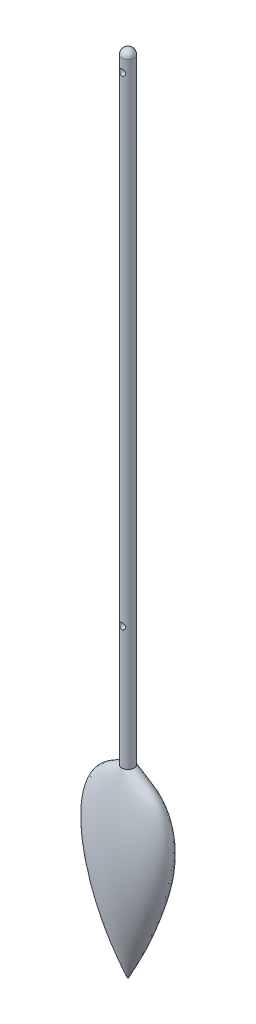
ISO-10303-21;
HEADER;
FILE_DESCRIPTION(('STEP AP214'),'2;1');
FILE_NAME('part.step','',(''),(''),'','','');
FILE_SCHEMA(('AUTOMOTIVE_DESIGN { 1 0 10303 214 1 1 1 1 }'));
ENDSEC;
DATA;
#1=APPLICATION_CONTEXT('core data for automotive mechanical design processes');
#2=APPLICATION_PROTOCOL_DEFINITION('international standard','automotive_design',2000,#1);
#3=PRODUCT_CONTEXT('',#1,'mechanical');
#4=PRODUCT('Part','Part','',(#3));
#5=PRODUCT_RELATED_PRODUCT_CATEGORY('part','',(#4));
#6=PRODUCT_DEFINITION_FORMATION('','',#4);
#7=PRODUCT_DEFINITION_CONTEXT('part definition',#1,'design');
#8=PRODUCT_DEFINITION('design','',#6,#7);
#9=PRODUCT_DEFINITION_SHAPE('','',#8);
#10=(LENGTH_UNIT() NAMED_UNIT(*) SI_UNIT(.MILLI.,.METRE.));
#11=(NAMED_UNIT(*) PLANE_ANGLE_UNIT() SI_UNIT($,.RADIAN.));
#12=(NAMED_UNIT(*) SI_UNIT($,.STERADIAN.) SOLID_ANGLE_UNIT());
#13=UNCERTAINTY_MEASURE_WITH_UNIT(LENGTH_MEASURE(1.E-05),#10,'distance_accuracy_value','');
#14=(GEOMETRIC_REPRESENTATION_CONTEXT(3) GLOBAL_UNCERTAINTY_ASSIGNED_CONTEXT((#13)) GLOBAL_UNIT_ASSIGNED_CONTEXT((#10,
#11,#12)) REPRESENTATION_CONTEXT('',''));
#15=CARTESIAN_POINT('',(0.,0.,0.));
#16=DIRECTION('',(0.,0.,1.));
#17=DIRECTION('',(1.,0.,0.));
#18=AXIS2_PLACEMENT_3D('',#15,#16,#17);
#19=CARTESIAN_POINT('',(0.,500.,0.));
#20=DIRECTION('',(0.,-1.,0.));
#21=DIRECTION('',(0.,0.,-1.));
#22=AXIS2_PLACEMENT_3D('',#19,#20,#21);
#23=CYLINDRICAL_SURFACE('',#22,5.);
#24=CARTESIAN_POINT('',(-2.5,100.,4.33012701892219));
#25=CARTESIAN_POINT('',(-2.49998948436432,100.130266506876,4.33013982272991));
#26=CARTESIAN_POINT('',(-2.48974954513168,100.260702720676,4.33609541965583));
#27=CARTESIAN_POINT('',(-2.44930840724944,100.517568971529,4.35905877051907));
#28=CARTESIAN_POINT('',(-2.41906526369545,100.643990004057,4.37608974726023));
#29=CARTESIAN_POINT('',(-2.34024976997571,100.888628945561,4.41873376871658));
#30=CARTESIAN_POINT('',(-2.29177485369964,101.006886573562,4.44430111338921));
#31=CARTESIAN_POINT('',(-2.17816884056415,101.233560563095,4.50106659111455));
#32=CARTESIAN_POINT('',(-2.11303684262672,101.341976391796,4.53226502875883));
#33=CARTESIAN_POINT('',(-1.96166634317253,101.555764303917,4.59992173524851));
#34=CARTESIAN_POINT('',(-1.87413008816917,101.66014783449,4.63660159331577));
#35=CARTESIAN_POINT('',(-1.68313452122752,101.853520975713,4.70929956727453));
#36=CARTESIAN_POINT('',(-1.57966731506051,101.942502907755,4.74531734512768));
#37=CARTESIAN_POINT('',(-1.35122390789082,102.108417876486,4.81553692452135));
#38=CARTESIAN_POINT('',(-1.22526797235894,102.184134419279,4.84945266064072));
#39=CARTESIAN_POINT('',(-0.96039256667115,102.312852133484,4.90876890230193));
#40=CARTESIAN_POINT('',(-0.821481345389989,102.365867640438,4.93417477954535));
#41=CARTESIAN_POINT('',(-0.545112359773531,102.443761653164,4.9720115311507));
#42=CARTESIAN_POINT('',(-0.408254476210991,102.470373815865,4.98523700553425));
#43=CARTESIAN_POINT('',(-0.131426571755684,102.500415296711,5.00018959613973));
#44=CARTESIAN_POINT('',(0.00854151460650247,102.503858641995,5.00192366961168));
#45=CARTESIAN_POINT('',(0.274581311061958,102.488133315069,4.99407454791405));
#46=CARTESIAN_POINT('',(0.400802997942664,102.470904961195,4.98546239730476));
#47=CARTESIAN_POINT('',(0.648284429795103,102.41779789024,4.95935613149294));
#48=CARTESIAN_POINT('',(0.769543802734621,102.38191777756,4.94186135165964));
#49=CARTESIAN_POINT('',(1.00577347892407,102.292293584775,4.89928958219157));
#50=CARTESIAN_POINT('',(1.12063355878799,102.23830921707,4.87411103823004));
#51=CARTESIAN_POINT('',(1.33994200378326,102.114341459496,4.81844114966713));
#52=CARTESIAN_POINT('',(1.44438662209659,102.044352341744,4.78794790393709));
#53=CARTESIAN_POINT('',(1.6504341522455,101.882761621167,4.72110985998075));
#54=CARTESIAN_POINT('',(1.7508351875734,101.789742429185,4.68448439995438));
#55=CARTESIAN_POINT('',(1.93526092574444,101.588525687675,4.61135851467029));
#56=CARTESIAN_POINT('',(2.01927302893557,101.480316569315,4.57485820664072));
#57=CARTESIAN_POINT('',(2.17376333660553,101.24337951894,4.50360390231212));
#58=CARTESIAN_POINT('',(2.24304328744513,101.113784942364,4.46910799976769));
#59=CARTESIAN_POINT('',(2.35829778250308,100.842655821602,4.4093862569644));
#60=CARTESIAN_POINT('',(2.40429664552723,100.701133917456,4.38415075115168));
#61=CARTESIAN_POINT('',(2.4679505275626,100.421963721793,4.34861589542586));
#62=CARTESIAN_POINT('',(2.48756280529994,100.284897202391,4.33729139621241));
#63=CARTESIAN_POINT('',(2.50379236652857,100.008996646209,4.32794798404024));
#64=CARTESIAN_POINT('',(2.50042589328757,99.8701639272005,4.32991967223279));
#65=CARTESIAN_POINT('',(2.47259010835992,99.6108652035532,4.34585841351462));
#66=CARTESIAN_POINT('',(2.45046954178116,99.4900513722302,4.35848968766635));
#67=CARTESIAN_POINT('',(2.38924071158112,99.2540805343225,4.39235053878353));
#68=CARTESIAN_POINT('',(2.35012694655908,99.1389253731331,4.41358290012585));
#69=CARTESIAN_POINT('',(2.25411897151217,98.9114716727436,4.46340555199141));
#70=CARTESIAN_POINT('',(2.19648515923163,98.7995524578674,4.49229108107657));
#71=CARTESIAN_POINT('',(2.0657176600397,98.5863268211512,4.55390298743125));
#72=CARTESIAN_POINT('',(1.99257601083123,98.4850258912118,4.58663133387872));
#73=CARTESIAN_POINT('',(1.82209291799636,98.2825530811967,4.65719996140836));
#74=CARTESIAN_POINT('',(1.72286318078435,98.1830071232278,4.69516457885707));
#75=CARTESIAN_POINT('',(1.50851123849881,98.0014694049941,4.76835587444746));
#76=CARTESIAN_POINT('',(1.39338368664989,97.9194835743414,4.80358162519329));
#77=CARTESIAN_POINT('',(1.14633840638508,97.7735656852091,4.86853404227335));
#78=CARTESIAN_POINT('',(1.01405774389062,97.7101672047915,4.89809104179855));
#79=CARTESIAN_POINT('',(0.738805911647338,97.607155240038,4.9470838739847));
#80=CARTESIAN_POINT('',(0.595844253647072,97.5675208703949,4.96652859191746));
#81=CARTESIAN_POINT('',(0.317449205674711,97.5165785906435,4.99168770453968));
#82=CARTESIAN_POINT('',(0.182528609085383,97.5030053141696,4.99849819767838));
#83=CARTESIAN_POINT('',(-0.0878149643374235,97.4978918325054,5.00105325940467));
#84=CARTESIAN_POINT('',(-0.22323774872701,97.5063439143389,4.99680170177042));
#85=CARTESIAN_POINT('',(-0.481344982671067,97.5435410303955,4.97834922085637));
#86=CARTESIAN_POINT('',(-0.604280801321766,97.5709121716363,4.96482236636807));
#87=CARTESIAN_POINT('',(-0.843614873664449,97.6433174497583,4.92980234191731));
#88=CARTESIAN_POINT('',(-0.960012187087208,97.6883541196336,4.90830802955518));
#89=CARTESIAN_POINT('',(-1.18855854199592,97.7968178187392,4.85814826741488));
#90=CARTESIAN_POINT('',(-1.30031295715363,97.8609490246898,4.82921542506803));
#91=CARTESIAN_POINT('',(-1.51193650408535,98.0048941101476,4.76720333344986));
#92=CARTESIAN_POINT('',(-1.61180014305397,98.0847151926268,4.73412218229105));
#93=CARTESIAN_POINT('',(-1.80728542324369,98.2669957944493,4.66321523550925));
#94=CARTESIAN_POINT('',(-1.90149582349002,98.3709177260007,4.62524489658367));
#95=CARTESIAN_POINT('',(-2.07165660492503,98.5936152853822,4.55157698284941));
#96=CARTESIAN_POINT('',(-2.1475908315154,98.7124039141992,4.51588143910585));
#97=CARTESIAN_POINT('',(-2.28108393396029,98.9666361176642,4.44998982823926));
#98=CARTESIAN_POINT('',(-2.3379862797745,99.1024873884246,4.42000320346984));
#99=CARTESIAN_POINT('',(-2.40494911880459,99.3132226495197,4.38370272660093));
#100=CARTESIAN_POINT('',(-2.42419582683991,99.3845597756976,4.37305486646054));
#101=CARTESIAN_POINT('',(-2.45635087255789,99.5290406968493,4.35507574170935));
#102=CARTESIAN_POINT('',(-2.46926364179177,99.6021831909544,4.34774215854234));
#103=CARTESIAN_POINT('',(-2.48591166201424,99.7295009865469,4.3382377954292));
#104=CARTESIAN_POINT('',(-2.49118864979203,99.7834163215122,4.33520487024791));
#105=CARTESIAN_POINT('',(-2.49823512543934,99.8915446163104,4.33114674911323));
#106=CARTESIAN_POINT('',(-2.50000437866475,99.9457575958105,4.33012168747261));
#107=CARTESIAN_POINT('',(-2.5,100.,4.33012701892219));
#108=B_SPLINE_CURVE_WITH_KNOTS('',3,(#24,#25,#26,#27,#28,#29,#30,#31,#32,#33,#34,#35,#36,#37,
#38,#39,#40,#41,#42,#43,#44,#45,#46,#47,#48,#49,#50,#51,#52,#53,#54,#55,#56,#57,#58,#59,#60,#61,
#62,#63,#64,#65,#66,#67,#68,#69,#70,#71,#72,#73,#74,#75,#76,#77,#78,#79,#80,#81,#82,#83,#84,#85,
#86,#87,#88,#89,#90,#91,#92,#93,#94,#95,#96,#97,#98,#99,#100,#101,#102,#103,#104,#105,#106,
#107),.UNSPECIFIED.,.T.,.F.,(4,2,2,2,2,2,2,2,2,2,2,2,2,2,2,2,2,2,2,2,2,2,2,2,2,2,2,2,2,2,2,2,2,
2,2,2,2,2,2,2,2,4),(0.,0.390580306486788,0.781982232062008,1.1713214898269,1.56068181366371,
1.98215578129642,2.40383927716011,2.85394730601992,3.30377067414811,3.72158712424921,
4.13915059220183,4.52040243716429,4.90168281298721,5.2882383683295,5.67493248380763,
6.09817978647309,6.5217512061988,6.97222104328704,7.42221935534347,7.83655727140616,
8.25060232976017,8.61935458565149,8.98822631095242,9.37418241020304,9.76033715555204,
10.1951685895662,10.6301466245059,11.076604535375,11.5226694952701,11.927806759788,
12.3328021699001,12.7111106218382,13.0894733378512,13.4840187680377,13.8787457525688,
14.3127560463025,14.7471485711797,15.195268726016,15.418924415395,15.6424233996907,
15.8050484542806,15.9676843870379),.UNSPECIFIED.);
#109=CARTESIAN_POINT('',(-2.5,100.,4.33012701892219));
#110=VERTEX_POINT('',#109);
#111=EDGE_CURVE('E154',#110,#110,#108,.T.);
#112=ORIENTED_EDGE('',*,*,#111,.T.);
#113=EDGE_LOOP('',(#112));
#114=FACE_BOUND('',#113,.T.);
#115=CARTESIAN_POINT('',(-2.5,490.,4.33012701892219));
#116=CARTESIAN_POINT('',(-2.49998948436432,490.130266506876,4.33013982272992));
#117=CARTESIAN_POINT('',(-2.48974954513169,490.260702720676,4.33609541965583));
#118=CARTESIAN_POINT('',(-2.44930840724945,490.517568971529,4.35905877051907));
#119=CARTESIAN_POINT('',(-2.41906526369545,490.643990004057,4.37608974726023));
#120=CARTESIAN_POINT('',(-2.34024976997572,490.888628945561,4.41873376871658));
#121=CARTESIAN_POINT('',(-2.29177485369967,491.006886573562,4.44430111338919));
#122=CARTESIAN_POINT('',(-2.17816884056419,491.233560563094,4.50106659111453));
#123=CARTESIAN_POINT('',(-2.11303684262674,491.341976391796,4.53226502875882));
#124=CARTESIAN_POINT('',(-1.96166634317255,491.555764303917,4.5999217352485));
#125=CARTESIAN_POINT('',(-1.87413008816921,491.66014783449,4.63660159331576));
#126=CARTESIAN_POINT('',(-1.68313452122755,491.853520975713,4.70929956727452));
#127=CARTESIAN_POINT('',(-1.57966731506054,491.942502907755,4.74531734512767));
#128=CARTESIAN_POINT('',(-1.35122390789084,492.108417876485,4.81553692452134));
#129=CARTESIAN_POINT('',(-1.22526797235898,492.184134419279,4.84945266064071));
#130=CARTESIAN_POINT('',(-0.960392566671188,492.312852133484,4.90876890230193));
#131=CARTESIAN_POINT('',(-0.82148134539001,492.365867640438,4.93417477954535));
#132=CARTESIAN_POINT('',(-0.545112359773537,492.443761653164,4.9720115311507));
#133=CARTESIAN_POINT('',(-0.408254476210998,492.470373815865,4.98523700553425));
#134=CARTESIAN_POINT('',(-0.131426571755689,492.500415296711,5.00018959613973));
#135=CARTESIAN_POINT('',(0.00854151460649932,492.503858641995,5.00192366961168));
#136=CARTESIAN_POINT('',(0.274581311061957,492.488133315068,4.99407454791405));
#137=CARTESIAN_POINT('',(0.400802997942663,492.470904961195,4.98546239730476));
#138=CARTESIAN_POINT('',(0.648284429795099,492.41779789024,4.95935613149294));
#139=CARTESIAN_POINT('',(0.769543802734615,492.38191777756,4.94186135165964));
#140=CARTESIAN_POINT('',(1.00577347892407,492.292293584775,4.89928958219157));
#141=CARTESIAN_POINT('',(1.12063355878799,492.23830921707,4.87411103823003));
#142=CARTESIAN_POINT('',(1.33994200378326,492.114341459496,4.81844114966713));
#143=CARTESIAN_POINT('',(1.44438662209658,492.044352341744,4.78794790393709));
#144=CARTESIAN_POINT('',(1.6504341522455,491.882761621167,4.72110985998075));
#145=CARTESIAN_POINT('',(1.75083518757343,491.789742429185,4.68448439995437));
#146=CARTESIAN_POINT('',(1.93526092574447,491.588525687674,4.61135851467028));
#147=CARTESIAN_POINT('',(2.01927302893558,491.480316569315,4.57485820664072));
#148=CARTESIAN_POINT('',(2.17376333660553,491.24337951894,4.50360390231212));
#149=CARTESIAN_POINT('',(2.24304328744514,491.113784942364,4.46910799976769));
#150=CARTESIAN_POINT('',(2.35829778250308,490.842655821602,4.40938625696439));
#151=CARTESIAN_POINT('',(2.40429664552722,490.701133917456,4.38415075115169));
#152=CARTESIAN_POINT('',(2.4679505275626,490.421963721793,4.34861589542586));
#153=CARTESIAN_POINT('',(2.48756280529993,490.284897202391,4.33729139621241));
#154=CARTESIAN_POINT('',(2.50379236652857,490.008996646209,4.32794798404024));
#155=CARTESIAN_POINT('',(2.50042589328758,489.8701639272,4.32991967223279));
#156=CARTESIAN_POINT('',(2.47259010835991,489.610865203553,4.34585841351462));
#157=CARTESIAN_POINT('',(2.45046954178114,489.49005137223,4.35848968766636));
#158=CARTESIAN_POINT('',(2.3892407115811,489.254080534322,4.39235053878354));
#159=CARTESIAN_POINT('',(2.35012694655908,489.138925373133,4.41358290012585));
#160=CARTESIAN_POINT('',(2.25411897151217,488.911471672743,4.46340555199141));
#161=CARTESIAN_POINT('',(2.19648515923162,488.799552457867,4.49229108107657));
#162=CARTESIAN_POINT('',(2.0657176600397,488.586326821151,4.55390298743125));
#163=CARTESIAN_POINT('',(1.99257601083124,488.485025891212,4.58663133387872));
#164=CARTESIAN_POINT('',(1.82209291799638,488.282553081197,4.65719996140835));
#165=CARTESIAN_POINT('',(1.72286318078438,488.183007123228,4.69516457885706));
#166=CARTESIAN_POINT('',(1.50851123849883,488.001469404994,4.76835587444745));
#167=CARTESIAN_POINT('',(1.39338368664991,487.919483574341,4.80358162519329));
#168=CARTESIAN_POINT('',(1.14633840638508,487.773565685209,4.86853404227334));
#169=CARTESIAN_POINT('',(1.01405774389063,487.710167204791,4.89809104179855));
#170=CARTESIAN_POINT('',(0.738805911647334,487.607155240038,4.9470838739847));
#171=CARTESIAN_POINT('',(0.595844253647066,487.567520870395,4.96652859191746));
#172=CARTESIAN_POINT('',(0.317449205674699,487.516578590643,4.99168770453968));
#173=CARTESIAN_POINT('',(0.182528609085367,487.50300531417,4.99849819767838));
#174=CARTESIAN_POINT('',(-0.0878149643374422,487.497891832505,5.00105325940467));
#175=CARTESIAN_POINT('',(-0.223237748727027,487.506343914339,4.99680170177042));
#176=CARTESIAN_POINT('',(-0.481344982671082,487.543541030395,4.97834922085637));
#177=CARTESIAN_POINT('',(-0.604280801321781,487.570912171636,4.96482236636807));
#178=CARTESIAN_POINT('',(-0.843614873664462,487.643317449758,4.92980234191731));
#179=CARTESIAN_POINT('',(-0.960012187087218,487.688354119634,4.90830802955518));
#180=CARTESIAN_POINT('',(-1.18855854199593,487.796817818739,4.85814826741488));
#181=CARTESIAN_POINT('',(-1.30031295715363,487.86094902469,4.82921542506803));
#182=CARTESIAN_POINT('',(-1.51193650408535,488.004894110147,4.76720333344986));
#183=CARTESIAN_POINT('',(-1.61180014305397,488.084715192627,4.73412218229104));
#184=CARTESIAN_POINT('',(-1.8072854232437,488.266995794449,4.66321523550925));
#185=CARTESIAN_POINT('',(-1.90149582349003,488.370917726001,4.62524489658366));
#186=CARTESIAN_POINT('',(-2.07165660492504,488.593615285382,4.55157698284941));
#187=CARTESIAN_POINT('',(-2.1475908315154,488.712403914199,4.51588143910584));
#188=CARTESIAN_POINT('',(-2.28108393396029,488.966636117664,4.44998982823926));
#189=CARTESIAN_POINT('',(-2.3379862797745,489.102487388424,4.42000320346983));
#190=CARTESIAN_POINT('',(-2.4049491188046,489.31322264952,4.38370272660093));
#191=CARTESIAN_POINT('',(-2.42419582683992,489.384559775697,4.37305486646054));
#192=CARTESIAN_POINT('',(-2.4563508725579,489.529040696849,4.35507574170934));
#193=CARTESIAN_POINT('',(-2.46926364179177,489.602183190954,4.34774215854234));
#194=CARTESIAN_POINT('',(-2.48591166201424,489.729500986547,4.3382377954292));
#195=CARTESIAN_POINT('',(-2.49118864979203,489.783416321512,4.33520487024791));
#196=CARTESIAN_POINT('',(-2.49823512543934,489.89154461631,4.33114674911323));
#197=CARTESIAN_POINT('',(-2.50000437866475,489.94575759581,4.33012168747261));
#198=CARTESIAN_POINT('',(-2.5,490.,4.33012701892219));
#199=B_SPLINE_CURVE_WITH_KNOTS('',3,(#115,#116,#117,#118,#119,#120,#121,#122,#123,#124,#125,
#126,#127,#128,#129,#130,#131,#132,#133,#134,#135,#136,#137,#138,#139,#140,#141,#142,#143,#144,
#145,#146,#147,#148,#149,#150,#151,#152,#153,#154,#155,#156,#157,#158,#159,#160,#161,#162,#163,
#164,#165,#166,#167,#168,#169,#170,#171,#172,#173,#174,#175,#176,#177,#178,#179,#180,#181,#182,
#183,#184,#185,#186,#187,#188,#189,#190,#191,#192,#193,#194,#195,#196,#197,#198),.UNSPECIFIED.,
.T.,.F.,(4,2,2,2,2,2,2,2,2,2,2,2,2,2,2,2,2,2,2,2,2,2,2,2,2,2,2,2,2,2,2,2,2,2,2,2,2,2,2,2,2,4),
(0.,0.390580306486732,0.781982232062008,1.17132148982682,1.56068181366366,1.98215578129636,
2.40383927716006,2.85394730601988,3.30377067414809,3.7215871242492,4.13915059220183,
4.52040243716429,4.9016828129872,5.28823836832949,5.67493248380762,6.09817978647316,
6.52175120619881,6.97222104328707,7.42221935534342,7.83655727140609,8.25060232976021,
8.61935458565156,8.98822631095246,9.37418241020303,9.76033715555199,10.1951685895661,
10.6301466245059,11.076604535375,11.5226694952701,11.927806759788,12.3328021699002,
12.7111106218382,13.0894733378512,13.4840187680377,13.8787457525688,14.3127560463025,
14.7471485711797,15.195268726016,15.418924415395,15.6424233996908,15.8050484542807,
15.9676843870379),.UNSPECIFIED.);
#200=CARTESIAN_POINT('',(-2.5,490.,4.33012701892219));
#201=VERTEX_POINT('',#200);
#202=EDGE_CURVE('E107',#201,#201,#199,.T.);
#203=ORIENTED_EDGE('',*,*,#202,.T.);
#204=EDGE_LOOP('',(#203));
#205=FACE_BOUND('',#204,.T.);
#206=CARTESIAN_POINT('',(0.,500.,0.));
#207=DIRECTION('',(0.,1.,0.));
#208=DIRECTION('',(0.,0.,1.));
#209=AXIS2_PLACEMENT_3D('',#206,#207,#208);
#210=CIRCLE('',#209,5.);
#211=CARTESIAN_POINT('',(0.,500.,5.));
#212=VERTEX_POINT('',#211);
#213=EDGE_CURVE('E13',#212,#212,#210,.T.);
#214=ORIENTED_EDGE('',*,*,#213,.F.);
#215=EDGE_LOOP('',(#214));
#216=FACE_BOUND('',#215,.T.);
#217=CARTESIAN_POINT('',(0.,0.,0.));
#218=DIRECTION('',(0.,1.,0.));
#219=DIRECTION('',(1.,0.,0.));
#220=AXIS2_PLACEMENT_3D('',#217,#218,#219);
#221=ELLIPSE('',#220,5.,5.);
#222=CARTESIAN_POINT('',(5.,0.,0.));
#223=VERTEX_POINT('',#222);
#224=EDGE_CURVE('E97',#223,#223,#221,.T.);
#225=ORIENTED_EDGE('',*,*,#224,.T.);
#226=EDGE_LOOP('',(#225));
#227=FACE_BOUND('',#226,.T.);
#228=CARTESIAN_POINT('',(2.5,490.,-4.33012701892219));
#229=CARTESIAN_POINT('',(2.49998948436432,489.869733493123,-4.33013982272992));
#230=CARTESIAN_POINT('',(2.48974954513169,489.739297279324,-4.33609541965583));
#231=CARTESIAN_POINT('',(2.44930840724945,489.482431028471,-4.35905877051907));
#232=CARTESIAN_POINT('',(2.41906526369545,489.356009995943,-4.37608974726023));
#233=CARTESIAN_POINT('',(2.3402497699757,489.111371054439,-4.41873376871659));
#234=CARTESIAN_POINT('',(2.29177485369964,488.993113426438,-4.44430111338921));
#235=CARTESIAN_POINT('',(2.17816884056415,488.766439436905,-4.50106659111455));
#236=CARTESIAN_POINT('',(2.11303684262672,488.658023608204,-4.53226502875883));
#237=CARTESIAN_POINT('',(1.96166634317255,488.444235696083,-4.5999217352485));
#238=CARTESIAN_POINT('',(1.87413008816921,488.33985216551,-4.63660159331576));
#239=CARTESIAN_POINT('',(1.68313452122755,488.146479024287,-4.70929956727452));
#240=CARTESIAN_POINT('',(1.57966731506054,488.057497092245,-4.74531734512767));
#241=CARTESIAN_POINT('',(1.35122390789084,487.891582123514,-4.81553692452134));
#242=CARTESIAN_POINT('',(1.22526797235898,487.815865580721,-4.84945266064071));
#243=CARTESIAN_POINT('',(0.960392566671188,487.687147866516,-4.90876890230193));
#244=CARTESIAN_POINT('',(0.82148134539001,487.634132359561,-4.93417477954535));
#245=CARTESIAN_POINT('',(0.545112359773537,487.556238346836,-4.9720115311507));
#246=CARTESIAN_POINT('',(0.408254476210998,487.529626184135,-4.98523700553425));
#247=CARTESIAN_POINT('',(0.131426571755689,487.499584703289,-5.00018959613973));
#248=CARTESIAN_POINT('',(-0.00854151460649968,487.496141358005,-5.00192366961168));
#249=CARTESIAN_POINT('',(-0.274581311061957,487.511866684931,-4.99407454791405));
#250=CARTESIAN_POINT('',(-0.400802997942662,487.529095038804,-4.98546239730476));
#251=CARTESIAN_POINT('',(-0.6482844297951,487.58220210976,-4.95935613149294));
#252=CARTESIAN_POINT('',(-0.769543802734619,487.61808222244,-4.94186135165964));
#253=CARTESIAN_POINT('',(-1.00577347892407,487.707706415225,-4.89928958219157));
#254=CARTESIAN_POINT('',(-1.120633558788,487.76169078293,-4.87411103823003));
#255=CARTESIAN_POINT('',(-1.33994200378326,487.885658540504,-4.81844114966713));
#256=CARTESIAN_POINT('',(-1.44438662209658,487.955647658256,-4.78794790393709));
#257=CARTESIAN_POINT('',(-1.65043415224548,488.117238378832,-4.72110985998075));
#258=CARTESIAN_POINT('',(-1.75083518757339,488.210257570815,-4.68448439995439));
#259=CARTESIAN_POINT('',(-1.93526092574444,488.411474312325,-4.61135851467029));
#260=CARTESIAN_POINT('',(-2.01927302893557,488.519683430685,-4.57485820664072));
#261=CARTESIAN_POINT('',(-2.17376333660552,488.75662048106,-4.50360390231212));
#262=CARTESIAN_POINT('',(-2.24304328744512,488.886215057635,-4.46910799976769));
#263=CARTESIAN_POINT('',(-2.35829778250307,489.157344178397,-4.4093862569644));
#264=CARTESIAN_POINT('',(-2.40429664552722,489.298866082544,-4.38415075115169));
#265=CARTESIAN_POINT('',(-2.4679505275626,489.578036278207,-4.34861589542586));
#266=CARTESIAN_POINT('',(-2.48756280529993,489.715102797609,-4.33729139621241));
#267=CARTESIAN_POINT('',(-2.50379236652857,489.991003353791,-4.32794798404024));
#268=CARTESIAN_POINT('',(-2.50042589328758,490.129836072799,-4.32991967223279));
#269=CARTESIAN_POINT('',(-2.47259010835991,490.389134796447,-4.34585841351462));
#270=CARTESIAN_POINT('',(-2.45046954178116,490.50994862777,-4.35848968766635));
#271=CARTESIAN_POINT('',(-2.38924071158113,490.745919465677,-4.39235053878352));
#272=CARTESIAN_POINT('',(-2.35012694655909,490.861074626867,-4.41358290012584));
#273=CARTESIAN_POINT('',(-2.25411897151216,491.088528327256,-4.46340555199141));
#274=CARTESIAN_POINT('',(-2.19648515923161,491.200447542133,-4.49229108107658));
#275=CARTESIAN_POINT('',(-2.06571766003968,491.413673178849,-4.55390298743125));
#276=CARTESIAN_POINT('',(-1.99257601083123,491.514974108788,-4.58663133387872));
#277=CARTESIAN_POINT('',(-1.82209291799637,491.717446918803,-4.65719996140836));
#278=CARTESIAN_POINT('',(-1.72286318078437,491.816992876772,-4.69516457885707));
#279=CARTESIAN_POINT('',(-1.50851123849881,491.998530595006,-4.76835587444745));
#280=CARTESIAN_POINT('',(-1.3933836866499,492.080516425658,-4.80358162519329));
#281=CARTESIAN_POINT('',(-1.14633840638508,492.226434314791,-4.86853404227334));
#282=CARTESIAN_POINT('',(-1.01405774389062,492.289832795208,-4.89809104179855));
#283=CARTESIAN_POINT('',(-0.738805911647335,492.392844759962,-4.9470838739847));
#284=CARTESIAN_POINT('',(-0.595844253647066,492.432479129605,-4.96652859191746));
#285=CARTESIAN_POINT('',(-0.317449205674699,492.483421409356,-4.99168770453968));
#286=CARTESIAN_POINT('',(-0.182528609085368,492.49699468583,-4.99849819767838));
#287=CARTESIAN_POINT('',(0.0878149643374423,492.502108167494,-5.00105325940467));
#288=CARTESIAN_POINT('',(0.22323774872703,492.493656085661,-4.99680170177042));
#289=CARTESIAN_POINT('',(0.481344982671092,492.456458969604,-4.97834922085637));
#290=CARTESIAN_POINT('',(0.604280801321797,492.429087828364,-4.96482236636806));
#291=CARTESIAN_POINT('',(0.843614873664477,492.356682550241,-4.92980234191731));
#292=CARTESIAN_POINT('',(0.960012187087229,492.311645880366,-4.90830802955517));
#293=CARTESIAN_POINT('',(1.18855854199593,492.203182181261,-4.85814826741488));
#294=CARTESIAN_POINT('',(1.30031295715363,492.13905097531,-4.82921542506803));
#295=CARTESIAN_POINT('',(1.51193650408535,491.995105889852,-4.76720333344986));
#296=CARTESIAN_POINT('',(1.61180014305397,491.915284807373,-4.73412218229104));
#297=CARTESIAN_POINT('',(1.8072854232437,491.733004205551,-4.66321523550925));
#298=CARTESIAN_POINT('',(1.90149582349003,491.629082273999,-4.62524489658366));
#299=CARTESIAN_POINT('',(2.07165660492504,491.406384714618,-4.55157698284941));
#300=CARTESIAN_POINT('',(2.1475908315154,491.287596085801,-4.51588143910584));
#301=CARTESIAN_POINT('',(2.28108393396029,491.033363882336,-4.44998982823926));
#302=CARTESIAN_POINT('',(2.3379862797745,490.897512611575,-4.42000320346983));
#303=CARTESIAN_POINT('',(2.4049491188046,490.68677735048,-4.38370272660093));
#304=CARTESIAN_POINT('',(2.42419582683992,490.615440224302,-4.37305486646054));
#305=CARTESIAN_POINT('',(2.4563508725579,490.47095930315,-4.35507574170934));
#306=CARTESIAN_POINT('',(2.46926364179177,490.397816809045,-4.34774215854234));
#307=CARTESIAN_POINT('',(2.48591166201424,490.270499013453,-4.3382377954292));
#308=CARTESIAN_POINT('',(2.49118864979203,490.216583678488,-4.33520487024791));
#309=CARTESIAN_POINT('',(2.49823512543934,490.108455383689,-4.33114674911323));
#310=CARTESIAN_POINT('',(2.50000437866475,490.054242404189,-4.33012168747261));
#311=CARTESIAN_POINT('',(2.5,490.,-4.33012701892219));
#312=B_SPLINE_CURVE_WITH_KNOTS('',3,(#228,#229,#230,#231,#232,#233,#234,#235,#236,#237,#238,
#239,#240,#241,#242,#243,#244,#245,#246,#247,#248,#249,#250,#251,#252,#253,#254,#255,#256,#257,
#258,#259,#260,#261,#262,#263,#264,#265,#266,#267,#268,#269,#270,#271,#272,#273,#274,#275,#276,
#277,#278,#279,#280,#281,#282,#283,#284,#285,#286,#287,#288,#289,#290,#291,#292,#293,#294,#295,
#296,#297,#298,#299,#300,#301,#302,#303,#304,#305,#306,#307,#308,#309,#310,#311),.UNSPECIFIED.,
.T.,.F.,(4,2,2,2,2,2,2,2,2,2,2,2,2,2,2,2,2,2,2,2,2,2,2,2,2,2,2,2,2,2,2,2,2,2,2,2,2,2,2,2,2,4),
(0.,0.390580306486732,0.781982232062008,1.17132148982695,1.56068181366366,1.98215578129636,
2.40383927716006,2.85394730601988,3.30377067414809,3.7215871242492,4.13915059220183,
4.52040243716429,4.9016828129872,5.28823836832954,5.67493248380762,6.09817978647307,
6.5217512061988,6.97222104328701,7.42221935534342,7.83655727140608,8.25060232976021,
8.61935458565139,8.98822631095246,9.37418241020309,9.76033715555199,10.1951685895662,
10.6301466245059,11.076604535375,11.5226694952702,11.927806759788,12.3328021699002,
12.7111106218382,13.0894733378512,13.4840187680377,13.8787457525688,14.3127560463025,
14.7471485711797,15.195268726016,15.418924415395,15.6424233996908,15.8050484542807,
15.9676843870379),.UNSPECIFIED.);
#313=CARTESIAN_POINT('',(2.5,490.,-4.33012701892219));
#314=VERTEX_POINT('',#313);
#315=EDGE_CURVE('E162',#314,#314,#312,.T.);
#316=ORIENTED_EDGE('',*,*,#315,.F.);
#317=EDGE_LOOP('',(#316));
#318=FACE_BOUND('',#317,.T.);
#319=CARTESIAN_POINT('',(2.5,100.,-4.33012701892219));
#320=CARTESIAN_POINT('',(2.49998948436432,99.8697334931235,-4.33013982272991));
#321=CARTESIAN_POINT('',(2.48974954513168,99.7392972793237,-4.33609541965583));
#322=CARTESIAN_POINT('',(2.44930840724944,99.4824310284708,-4.35905877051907));
#323=CARTESIAN_POINT('',(2.41906526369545,99.3560099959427,-4.37608974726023));
#324=CARTESIAN_POINT('',(2.3402497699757,99.1113710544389,-4.41873376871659));
#325=CARTESIAN_POINT('',(2.29177485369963,98.9931134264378,-4.44430111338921));
#326=CARTESIAN_POINT('',(2.17816884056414,98.7664394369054,-4.50106659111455));
#327=CARTESIAN_POINT('',(2.11303684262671,98.6580236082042,-4.53226502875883));
#328=CARTESIAN_POINT('',(1.96166634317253,98.444235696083,-4.59992173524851));
#329=CARTESIAN_POINT('',(1.87413008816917,98.3398521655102,-4.63660159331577));
#330=CARTESIAN_POINT('',(1.68313452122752,98.1464790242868,-4.70929956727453));
#331=CARTESIAN_POINT('',(1.57966731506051,98.057497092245,-4.74531734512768));
#332=CARTESIAN_POINT('',(1.35122390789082,97.8915821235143,-4.81553692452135));
#333=CARTESIAN_POINT('',(1.22526797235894,97.8158655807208,-4.84945266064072));
#334=CARTESIAN_POINT('',(0.96039256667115,97.6871478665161,-4.90876890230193));
#335=CARTESIAN_POINT('',(0.821481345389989,97.6341323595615,-4.93417477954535));
#336=CARTESIAN_POINT('',(0.545112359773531,97.556238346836,-4.9720115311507));
#337=CARTESIAN_POINT('',(0.408254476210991,97.5296261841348,-4.98523700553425));
#338=CARTESIAN_POINT('',(0.131426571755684,97.4995847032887,-5.00018959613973));
#339=CARTESIAN_POINT('',(-0.00854151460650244,97.4961413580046,-5.00192366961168));
#340=CARTESIAN_POINT('',(-0.274581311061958,97.5118666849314,-4.99407454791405));
#341=CARTESIAN_POINT('',(-0.400802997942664,97.5290950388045,-4.98546239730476));
#342=CARTESIAN_POINT('',(-0.648284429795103,97.5822021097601,-4.95935613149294));
#343=CARTESIAN_POINT('',(-0.769543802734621,97.6180822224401,-4.94186135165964));
#344=CARTESIAN_POINT('',(-1.00577347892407,97.7077064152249,-4.89928958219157));
#345=CARTESIAN_POINT('',(-1.12063355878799,97.7616907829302,-4.87411103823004));
#346=CARTESIAN_POINT('',(-1.33994200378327,97.8856585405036,-4.81844114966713));
#347=CARTESIAN_POINT('',(-1.4443866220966,97.9556476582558,-4.78794790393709));
#348=CARTESIAN_POINT('',(-1.6504341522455,98.1172383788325,-4.72110985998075));
#349=CARTESIAN_POINT('',(-1.7508351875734,98.210257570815,-4.68448439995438));
#350=CARTESIAN_POINT('',(-1.93526092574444,98.4114743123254,-4.61135851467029));
#351=CARTESIAN_POINT('',(-2.01927302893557,98.5196834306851,-4.57485820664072));
#352=CARTESIAN_POINT('',(-2.17376333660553,98.7566204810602,-4.50360390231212));
#353=CARTESIAN_POINT('',(-2.24304328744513,98.8862150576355,-4.46910799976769));
#354=CARTESIAN_POINT('',(-2.35829778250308,99.1573441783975,-4.4093862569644));
#355=CARTESIAN_POINT('',(-2.40429664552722,99.2988660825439,-4.38415075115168));
#356=CARTESIAN_POINT('',(-2.4679505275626,99.5780362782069,-4.34861589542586));
#357=CARTESIAN_POINT('',(-2.48756280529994,99.7151027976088,-4.33729139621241));
#358=CARTESIAN_POINT('',(-2.50379236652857,99.9910033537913,-4.32794798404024));
#359=CARTESIAN_POINT('',(-2.50042589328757,100.129836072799,-4.32991967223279));
#360=CARTESIAN_POINT('',(-2.47259010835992,100.389134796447,-4.34585841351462));
#361=CARTESIAN_POINT('',(-2.45046954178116,100.50994862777,-4.35848968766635));
#362=CARTESIAN_POINT('',(-2.38924071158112,100.745919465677,-4.39235053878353));
#363=CARTESIAN_POINT('',(-2.35012694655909,100.861074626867,-4.41358290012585));
#364=CARTESIAN_POINT('',(-2.25411897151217,101.088528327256,-4.46340555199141));
#365=CARTESIAN_POINT('',(-2.19648515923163,101.200447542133,-4.49229108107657));
#366=CARTESIAN_POINT('',(-2.0657176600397,101.413673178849,-4.55390298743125));
#367=CARTESIAN_POINT('',(-1.99257601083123,101.514974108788,-4.58663133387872));
#368=CARTESIAN_POINT('',(-1.82209291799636,101.717446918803,-4.65719996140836));
#369=CARTESIAN_POINT('',(-1.72286318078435,101.816992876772,-4.69516457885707));
#370=CARTESIAN_POINT('',(-1.50851123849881,101.998530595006,-4.76835587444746));
#371=CARTESIAN_POINT('',(-1.39338368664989,102.080516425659,-4.80358162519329));
#372=CARTESIAN_POINT('',(-1.14633840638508,102.226434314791,-4.86853404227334));
#373=CARTESIAN_POINT('',(-1.01405774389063,102.289832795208,-4.89809104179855));
#374=CARTESIAN_POINT('',(-0.73880591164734,102.392844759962,-4.9470838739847));
#375=CARTESIAN_POINT('',(-0.595844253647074,102.432479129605,-4.96652859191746));
#376=CARTESIAN_POINT('',(-0.317449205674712,102.483421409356,-4.99168770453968));
#377=CARTESIAN_POINT('',(-0.182528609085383,102.49699468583,-4.99849819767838));
#378=CARTESIAN_POINT('',(0.0878149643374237,102.502108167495,-5.00105325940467));
#379=CARTESIAN_POINT('',(0.22323774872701,102.493656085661,-4.99680170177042));
#380=CARTESIAN_POINT('',(0.481344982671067,102.456458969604,-4.97834922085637));
#381=CARTESIAN_POINT('',(0.604280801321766,102.429087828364,-4.96482236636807));
#382=CARTESIAN_POINT('',(0.843614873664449,102.356682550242,-4.92980234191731));
#383=CARTESIAN_POINT('',(0.960012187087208,102.311645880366,-4.90830802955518));
#384=CARTESIAN_POINT('',(1.18855854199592,102.203182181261,-4.85814826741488));
#385=CARTESIAN_POINT('',(1.30031295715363,102.13905097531,-4.82921542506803));
#386=CARTESIAN_POINT('',(1.51193650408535,101.995105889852,-4.76720333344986));
#387=CARTESIAN_POINT('',(1.61180014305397,101.915284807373,-4.73412218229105));
#388=CARTESIAN_POINT('',(1.80728542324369,101.733004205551,-4.66321523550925));
#389=CARTESIAN_POINT('',(1.90149582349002,101.629082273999,-4.62524489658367));
#390=CARTESIAN_POINT('',(2.07165660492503,101.406384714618,-4.55157698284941));
#391=CARTESIAN_POINT('',(2.1475908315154,101.287596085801,-4.51588143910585));
#392=CARTESIAN_POINT('',(2.28108393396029,101.033363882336,-4.44998982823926));
#393=CARTESIAN_POINT('',(2.3379862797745,100.897512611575,-4.42000320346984));
#394=CARTESIAN_POINT('',(2.40494911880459,100.68677735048,-4.38370272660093));
#395=CARTESIAN_POINT('',(2.42419582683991,100.615440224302,-4.37305486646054));
#396=CARTESIAN_POINT('',(2.45635087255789,100.470959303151,-4.35507574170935));
#397=CARTESIAN_POINT('',(2.46926364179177,100.397816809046,-4.34774215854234));
#398=CARTESIAN_POINT('',(2.48591166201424,100.270499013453,-4.3382377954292));
#399=CARTESIAN_POINT('',(2.49118864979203,100.216583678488,-4.33520487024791));
#400=CARTESIAN_POINT('',(2.49823512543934,100.10845538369,-4.33114674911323));
#401=CARTESIAN_POINT('',(2.50000437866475,100.054242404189,-4.33012168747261));
#402=CARTESIAN_POINT('',(2.5,100.,-4.33012701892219));
#403=B_SPLINE_CURVE_WITH_KNOTS('',3,(#319,#320,#321,#322,#323,#324,#325,#326,#327,#328,#329,
#330,#331,#332,#333,#334,#335,#336,#337,#338,#339,#340,#341,#342,#343,#344,#345,#346,#347,#348,
#349,#350,#351,#352,#353,#354,#355,#356,#357,#358,#359,#360,#361,#362,#363,#364,#365,#366,#367,
#368,#369,#370,#371,#372,#373,#374,#375,#376,#377,#378,#379,#380,#381,#382,#383,#384,#385,#386,
#387,#388,#389,#390,#391,#392,#393,#394,#395,#396,#397,#398,#399,#400,#401,#402),.UNSPECIFIED.,
.T.,.F.,(4,2,2,2,2,2,2,2,2,2,2,2,2,2,2,2,2,2,2,2,2,2,2,2,2,2,2,2,2,2,2,2,2,2,2,2,2,2,2,2,2,4),
(0.,0.390580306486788,0.781982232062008,1.17132148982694,1.56068181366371,1.98215578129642,
2.40383927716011,2.85394730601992,3.30377067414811,3.72158712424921,4.13915059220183,
4.52040243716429,4.90168281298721,5.2882383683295,5.67493248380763,6.09817978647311,
6.5217512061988,6.97222104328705,7.42221935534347,7.83655727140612,8.25060232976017,
8.61935458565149,8.98822631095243,9.37418241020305,9.76033715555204,10.1951685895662,
10.6301466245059,11.076604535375,11.5226694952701,11.927806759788,12.3328021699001,
12.7111106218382,13.0894733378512,13.4840187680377,13.8787457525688,14.3127560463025,
14.7471485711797,15.195268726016,15.418924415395,15.6424233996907,15.8050484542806,
15.9676843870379),.UNSPECIFIED.);
#404=CARTESIAN_POINT('',(2.5,100.,-4.33012701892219));
#405=VERTEX_POINT('',#404);
#406=EDGE_CURVE('E165',#405,#405,#403,.T.);
#407=ORIENTED_EDGE('',*,*,#406,.F.);
#408=EDGE_LOOP('',(#407));
#409=FACE_BOUND('',#408,.T.);
#410=ADVANCED_FACE('F90',(#114,#205,#216,#227,#318,#409),#23,.T.);
#411=CARTESIAN_POINT('',(0.,500.,0.));
#412=DIRECTION('',(0.,0.,1.));
#413=DIRECTION('',(1.,0.,0.));
#414=AXIS2_PLACEMENT_3D('',#411,#412,#413);
#415=SPHERICAL_SURFACE('',#414,5.);
#416=CARTESIAN_POINT('',(0.,500.,0.));
#417=DIRECTION('',(0.,1.,0.));
#418=DIRECTION('',(0.,0.,1.));
#419=AXIS2_PLACEMENT_3D('',#416,#417,#418);
#420=SPHERICAL_SURFACE('',#419,5.);
#421=ORIENTED_EDGE('',*,*,#213,.T.);
#422=EDGE_LOOP('',(#421));
#423=FACE_BOUND('',#422,.T.);
#424=ADVANCED_FACE('F92',(#423),#420,.T.);
#425=CARTESIAN_POINT('',(0.,-150.,0.));
#426=DIRECTION('',(0.,1.,0.));
#427=DIRECTION('',(0.,0.,1.));
#428=AXIS2_PLACEMENT_3D('',#425,#426,#427);
#429=PLANE('',#428);
#430=CARTESIAN_POINT('',(0.,-150.,0.));
#431=DIRECTION('',(0.,1.,0.));
#432=DIRECTION('',(0.,0.,1.));
#433=AXIS2_PLACEMENT_3D('',#430,#431,#432);
#434=ELLIPSE('',#433,0.499999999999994,0.49999999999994);
#435=CARTESIAN_POINT('',(0.,-150.,0.499999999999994));
#436=VERTEX_POINT('',#435);
#437=EDGE_CURVE('E101',#436,#436,#434,.T.);
#438=ORIENTED_EDGE('',*,*,#437,.F.);
#439=EDGE_LOOP('',(#438));
#440=FACE_BOUND('',#439,.T.);
#441=ADVANCED_FACE('F124',(#440),#429,.F.);
#442=CARTESIAN_POINT('',(-5.,0.,-0.064931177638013));
#443=CARTESIAN_POINT('',(-9.32636358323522,-1.93306631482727,-0.0738233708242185));
#444=CARTESIAN_POINT('',(-17.601200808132,-5.63035360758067,-0.0908310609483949));
#445=CARTESIAN_POINT('',(-23.3267595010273,-11.2623791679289,-0.109045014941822));
#446=CARTESIAN_POINT('',(-28.067774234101,-17.1813198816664,-0.127688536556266));
#447=CARTESIAN_POINT('',(-30.657531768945,-21.8454377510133,-0.141637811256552));
#448=CARTESIAN_POINT('',(-32.9944698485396,-28.1328286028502,-0.15871501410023));
#449=CARTESIAN_POINT('',(-34.597317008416,-34.4834385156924,-0.173804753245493));
#450=CARTESIAN_POINT('',(-35.3931817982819,-41.7367629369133,-0.186631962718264));
#451=CARTESIAN_POINT('',(-35.4118294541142,-48.579930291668,-0.195343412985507));
#452=CARTESIAN_POINT('',(-35.043419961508,-55.2472140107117,-0.20185623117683));
#453=CARTESIAN_POINT('',(-34.4223129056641,-60.0944926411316,-0.204616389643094));
#454=CARTESIAN_POINT('',(-33.3071122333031,-66.7609872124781,-0.206387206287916));
#455=CARTESIAN_POINT('',(-32.5395415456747,-70.4572259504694,-0.206189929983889));
#456=CARTESIAN_POINT('',(-30.2546965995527,-80.0379344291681,-0.202482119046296));
#457=CARTESIAN_POINT('',(-27.5650184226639,-88.9091548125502,-0.192813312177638));
#458=CARTESIAN_POINT('',(-22.8161740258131,-102.141667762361,-0.169666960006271));
#459=CARTESIAN_POINT('',(-19.4966023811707,-110.269472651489,-0.151205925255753));
#460=CARTESIAN_POINT('',(-16.5819299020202,-117.043648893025,-0.133681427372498));
#461=CARTESIAN_POINT('',(-13.6219108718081,-123.689712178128,-0.11456871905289));
#462=CARTESIAN_POINT('',(-11.0897960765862,-129.045552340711,-0.095325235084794));
#463=CARTESIAN_POINT('',(-6.63601543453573,-138.202444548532,-0.0593308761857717));
#464=CARTESIAN_POINT('',(-3.40848540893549,-144.40793161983,-0.031538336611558));
#465=CARTESIAN_POINT('',(-0.49999999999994,-150.,-0.00649311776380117));
#466=CARTESIAN_POINT('',(-5.,0.,-0.137978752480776));
#467=CARTESIAN_POINT('',(-9.32636358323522,-1.93306631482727,-0.156874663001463));
#468=CARTESIAN_POINT('',(-17.601200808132,-5.63035360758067,-0.193016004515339));
#469=CARTESIAN_POINT('',(-23.3267595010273,-11.2623791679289,-0.231720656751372));
#470=CARTESIAN_POINT('',(-28.0677742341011,-17.1813198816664,-0.271338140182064));
#471=CARTESIAN_POINT('',(-30.657531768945,-21.8454377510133,-0.300980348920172));
#472=CARTESIAN_POINT('',(-32.9944698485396,-28.1328286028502,-0.337269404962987));
#473=CARTESIAN_POINT('',(-34.597317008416,-34.4834385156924,-0.369335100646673));
#474=CARTESIAN_POINT('',(-35.3931817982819,-41.7367629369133,-0.396592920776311));
#475=CARTESIAN_POINT('',(-35.4118294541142,-48.579930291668,-0.415104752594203));
#476=CARTESIAN_POINT('',(-35.043419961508,-55.2472140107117,-0.428944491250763));
#477=CARTESIAN_POINT('',(-34.4223129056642,-60.0944926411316,-0.434809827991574));
#478=CARTESIAN_POINT('',(-33.3071122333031,-66.7609872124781,-0.438572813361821));
#479=CARTESIAN_POINT('',(-32.5395415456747,-70.4572259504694,-0.438153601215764));
#480=CARTESIAN_POINT('',(-30.2546965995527,-80.037934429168,-0.43027450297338));
#481=CARTESIAN_POINT('',(-27.5650184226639,-88.9091548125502,-0.409728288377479));
#482=CARTESIAN_POINT('',(-22.8161740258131,-102.141667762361,-0.360542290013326));
#483=CARTESIAN_POINT('',(-19.4966023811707,-110.269472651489,-0.321312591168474));
#484=CARTESIAN_POINT('',(-16.5819299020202,-117.043648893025,-0.284073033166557));
#485=CARTESIAN_POINT('',(-13.6219108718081,-123.689712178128,-0.24345852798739));
#486=CARTESIAN_POINT('',(-11.0897960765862,-129.045552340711,-0.202566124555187));
#487=CARTESIAN_POINT('',(-6.63601543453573,-138.202444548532,-0.126078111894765));
#488=CARTESIAN_POINT('',(-3.40848540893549,-144.40793161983,-0.0670189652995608));
#489=CARTESIAN_POINT('',(-0.49999999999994,-150.,-0.0137978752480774));
#490=CARTESIAN_POINT('',(-4.98879787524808,0.,-0.41134050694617));
#491=CARTESIAN_POINT('',(-9.30598994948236,-1.93325430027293,-0.467656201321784));
#492=CARTESIAN_POINT('',(-17.5632852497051,-5.63090114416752,-0.575368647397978));
#493=CARTESIAN_POINT('',(-23.2746803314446,-11.2624632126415,-0.690797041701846));
#494=CARTESIAN_POINT('',(-28.0046316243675,-17.181182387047,-0.808920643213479));
#495=CARTESIAN_POINT('',(-30.5887179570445,-21.8453166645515,-0.897275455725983));
#496=CARTESIAN_POINT('',(-32.9205907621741,-28.1328277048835,-1.00546683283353));
#497=CARTESIAN_POINT('',(-34.5198175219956,-34.4835663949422,-1.10106213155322));
#498=CARTESIAN_POINT('',(-35.3139130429,-41.7368755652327,-1.18232082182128));
#499=CARTESIAN_POINT('',(-35.3324978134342,-48.5799540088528,-1.23750473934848));
#500=CARTESIAN_POINT('',(-34.9648893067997,-55.2471641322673,-1.27876152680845));
#501=CARTESIAN_POINT('',(-34.3451705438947,-60.0944537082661,-1.29624934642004));
#502=CARTESIAN_POINT('',(-33.2324594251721,-66.7609550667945,-1.30746957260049));
#503=CARTESIAN_POINT('',(-32.4666021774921,-70.4571906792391,-1.30622035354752));
#504=CARTESIAN_POINT('',(-30.1870348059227,-80.0380505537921,-1.28272582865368));
#505=CARTESIAN_POINT('',(-27.5038401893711,-88.9097003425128,-1.22145570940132));
#506=CARTESIAN_POINT('',(-22.765565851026,-102.141997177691,-1.07482320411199));
#507=CARTESIAN_POINT('',(-19.4532067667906,-110.26967440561,-0.95788040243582));
#508=CARTESIAN_POINT('',(-16.5447869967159,-117.043654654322,-0.846872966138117));
#509=CARTESIAN_POINT('',(-13.5911761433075,-123.689562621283,-0.725805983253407));
#510=CARTESIAN_POINT('',(-11.0648613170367,-129.045514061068,-0.603903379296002));
#511=CARTESIAN_POINT('',(-6.62124341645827,-138.202506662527,-0.375849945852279));
#512=CARTESIAN_POINT('',(-3.40089420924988,-144.407961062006,-0.199790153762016));
#513=CARTESIAN_POINT('',(-0.498879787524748,-150.,-0.0411340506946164));
#514=CARTESIAN_POINT('',(-4.93967927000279,0.,-0.812304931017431));
#515=CARTESIAN_POINT('',(-9.21665387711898,-1.93408143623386,-0.923459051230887));
#516=CARTESIAN_POINT('',(-17.3970270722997,-5.63331030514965,-1.13605843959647));
#517=CARTESIAN_POINT('',(-23.046324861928,-11.262833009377,-1.36414937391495));
#518=CARTESIAN_POINT('',(-27.7277678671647,-17.1805774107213,-1.59747329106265));
#519=CARTESIAN_POINT('',(-30.2869866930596,-21.8447838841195,-1.77190564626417));
#520=CARTESIAN_POINT('',(-32.5966486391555,-28.1328237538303,-1.98558291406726));
#521=CARTESIAN_POINT('',(-34.1800009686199,-34.4841290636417,-2.17436709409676));
#522=CARTESIAN_POINT('',(-34.9663386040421,-41.7373711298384,-2.3348279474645));
#523=CARTESIAN_POINT('',(-34.9846477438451,-48.5800583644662,-2.44379239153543));
#524=CARTESIAN_POINT('',(-34.6205514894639,-55.2469446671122,-2.52525818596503));
#525=CARTESIAN_POINT('',(-34.0069200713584,-60.0942824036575,-2.5598000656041));
#526=CARTESIAN_POINT('',(-32.9051250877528,-66.7608136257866,-2.58196454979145));
#527=CARTESIAN_POINT('',(-32.1467808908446,-70.4570354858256,-2.57949944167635));
#528=CARTESIAN_POINT('',(-29.8903536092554,-80.0385615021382,-2.53308435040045));
#529=CARTESIAN_POINT('',(-27.2355855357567,-88.9121006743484,-2.41202798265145));
#530=CARTESIAN_POINT('',(-22.5436586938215,-102.143446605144,-2.12246236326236));
#531=CARTESIAN_POINT('',(-19.2629260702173,-110.27056212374,-1.89155500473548));
#532=CARTESIAN_POINT('',(-16.381924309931,-117.043680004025,-1.6723768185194));
#533=CARTESIAN_POINT('',(-13.4564128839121,-123.688904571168,-1.43333946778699));
#534=CARTESIAN_POINT('',(-10.9555288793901,-129.045345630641,-1.19262744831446));
#535=CARTESIAN_POINT('',(-6.55647121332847,-138.202779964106,-0.742176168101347));
#536=CARTESIAN_POINT('',(-3.3676084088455,-144.408090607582,-0.394520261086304));
#537=CARTESIAN_POINT('',(-0.49396792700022,-150.,-0.081230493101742));
#538=CARTESIAN_POINT('',(-4.85953620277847,0.,-1.2029001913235));
#539=CARTESIAN_POINT('',(-9.07088746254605,-1.93543493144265,-1.36742634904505));
#540=CARTESIAN_POINT('',(-17.1257458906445,-5.63725256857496,-1.68210798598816));
#541=CARTESIAN_POINT('',(-22.6737334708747,-11.2634381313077,-2.02007200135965));
#542=CARTESIAN_POINT('',(-27.2760322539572,-17.1795874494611,-2.36566505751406));
#543=CARTESIAN_POINT('',(-29.7946757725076,-21.8439120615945,-2.62390767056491));
#544=CARTESIAN_POINT('',(-32.0680967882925,-28.1328172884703,-2.94036302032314));
#545=CARTESIAN_POINT('',(-33.6255482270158,-34.4850497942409,-3.2199304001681));
#546=CARTESIAN_POINT('',(-34.3992278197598,-41.7381820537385,-3.45753944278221));
#547=CARTESIAN_POINT('',(-34.4170873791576,-48.5802291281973,-3.61888394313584));
#548=CARTESIAN_POINT('',(-34.0587219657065,-55.2465855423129,-3.73951289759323));
#549=CARTESIAN_POINT('',(-33.4550228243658,-60.0940020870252,-3.79067408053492));
#550=CARTESIAN_POINT('',(-32.3710389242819,-66.7605821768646,-3.8235058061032));
#551=CARTESIAN_POINT('',(-31.6249532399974,-70.4567815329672,-3.81985779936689));
#552=CARTESIAN_POINT('',(-29.4062807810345,-80.0393975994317,-3.75109897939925));
#553=CARTESIAN_POINT('',(-26.7978909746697,-88.9160284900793,-3.5717500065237));
#554=CARTESIAN_POINT('',(-22.1815862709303,-102.145818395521,-3.14294809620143));
#555=CARTESIAN_POINT('',(-18.9524576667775,-110.272014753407,-2.80104749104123));
#556=CARTESIAN_POINT('',(-16.1161936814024,-117.043721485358,-2.47652697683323));
#557=CARTESIAN_POINT('',(-13.2365314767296,-123.687827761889,-2.12260635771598));
#558=CARTESIAN_POINT('',(-10.7771401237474,-129.045070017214,-1.76617287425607));
#559=CARTESIAN_POINT('',(-6.45078671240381,-138.203227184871,-1.09899250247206));
#560=CARTESIAN_POINT('',(-3.31329820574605,-144.408302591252,-0.584197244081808));
#561=CARTESIAN_POINT('',(-0.485953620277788,-150.,-0.120290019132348));
#562=CARTESIAN_POINT('',(-4.2002767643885,0.,-3.47651103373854));
#563=CARTESIAN_POINT('',(-7.8717785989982,-1.94660126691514,-3.95142025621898));
#564=CARTESIAN_POINT('',(-14.8940917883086,-5.66977624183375,-4.85975734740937));
#565=CARTESIAN_POINT('',(-19.6087743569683,-11.2684303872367,-5.83802478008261));
#566=CARTESIAN_POINT('',(-23.5600553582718,-17.1714202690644,-6.83741171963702));
#567=CARTESIAN_POINT('',(-25.7449176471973,-21.836719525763,-7.58325663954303));
#568=CARTESIAN_POINT('',(-27.7202099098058,-28.132763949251,-8.49809232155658));
#569=CARTESIAN_POINT('',(-29.064601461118,-34.4926458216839,-9.30612386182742));
#570=CARTESIAN_POINT('',(-29.7341548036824,-41.7448721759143,-9.9927692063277));
#571=CARTESIAN_POINT('',(-29.7483173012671,-48.5816379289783,-10.4589540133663));
#572=CARTESIAN_POINT('',(-29.4370953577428,-55.2436227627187,-10.8075111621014));
#573=CARTESIAN_POINT('',(-28.9150996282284,-60.0916894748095,-10.9554490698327));
#574=CARTESIAN_POINT('',(-27.9776307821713,-66.7586727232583,-11.0504096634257));
#575=CARTESIAN_POINT('',(-27.3323843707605,-70.4546864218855,-11.0398854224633));
#576=CARTESIAN_POINT('',(-25.4242752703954,-80.0462954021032,-10.8409708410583));
#577=CARTESIAN_POINT('',(-23.1973685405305,-88.9484329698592,-10.3219923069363));
#578=CARTESIAN_POINT('',(-19.2031379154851,-102.16538566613,-9.082714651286));
#579=CARTESIAN_POINT('',(-16.3985184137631,-110.283998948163,-8.09487970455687));
#580=CARTESIAN_POINT('',(-13.9302845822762,-117.044063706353,-7.15735988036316));
#581=CARTESIAN_POINT('',(-11.4277922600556,-123.678944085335,-6.13493475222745));
#582=CARTESIAN_POINT('',(-9.30971356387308,-129.04279620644,-5.10499259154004));
#583=CARTESIAN_POINT('',(-5.58141718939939,-138.206916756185,-3.1757610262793));
#584=CARTESIAN_POINT('',(-2.86653816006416,-144.410051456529,-1.68818170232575));
#585=CARTESIAN_POINT('',(-0.420027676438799,-150.,-0.34765110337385));
#586=CARTESIAN_POINT('',(-2.2076600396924,0.,-5.));
#587=CARTESIAN_POINT('',(-4.24715400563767,-1.98068929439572,-5.68054608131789));
#588=CARTESIAN_POINT('',(-8.14800058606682,-5.76906287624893,-6.98219536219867));
#589=CARTESIAN_POINT('',(-10.3448036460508,-11.2836704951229,-8.39553968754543));
#590=CARTESIAN_POINT('',(-12.3286399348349,-17.1464879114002,-9.83534726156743));
#591=CARTESIAN_POINT('',(-13.5045683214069,-21.8147625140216,-10.9059174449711));
#592=CARTESIAN_POINT('',(-14.5786631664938,-28.1326011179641,-12.2226896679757));
#593=CARTESIAN_POINT('',(-15.2790969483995,-34.5158345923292,-13.3850373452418));
#594=CARTESIAN_POINT('',(-15.6339197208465,-41.7652954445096,-14.3722906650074));
#595=CARTESIAN_POINT('',(-15.6369203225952,-48.5859386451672,-15.0422712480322));
#596=CARTESIAN_POINT('',(-15.4682043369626,-55.2345781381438,-15.5432649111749));
#597=CARTESIAN_POINT('',(-15.1931597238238,-60.0846296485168,-15.7563550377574));
#598=CARTESIAN_POINT('',(-14.6985390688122,-66.7528436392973,-15.8932384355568));
#599=CARTESIAN_POINT('',(-14.358083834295,-70.4482905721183,-15.8781817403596));
#600=CARTESIAN_POINT('',(-13.3885609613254,-80.0673526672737,-15.59128072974));
#601=CARTESIAN_POINT('',(-12.3144187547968,-89.0473557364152,-14.8421767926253));
#602=CARTESIAN_POINT('',(-10.2004529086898,-102.225119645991,-13.0598438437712));
#603=CARTESIAN_POINT('',(-8.67904852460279,-110.320583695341,-11.6403564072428));
#604=CARTESIAN_POINT('',(-7.3233529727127,-117.0451084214,-10.2935902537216));
#605=CARTESIAN_POINT('',(-5.96099192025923,-123.651824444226,-8.82498136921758));
#606=CARTESIAN_POINT('',(-4.87445815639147,-129.03585483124,-7.34448972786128));
#607=CARTESIAN_POINT('',(-2.95368456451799,-138.218180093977,-4.56557865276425));
#608=CARTESIAN_POINT('',(-1.51617567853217,-144.415390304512,-2.42709361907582));
#609=CARTESIAN_POINT('',(-0.220766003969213,-150.,-0.499999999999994));
#610=CARTESIAN_POINT('',(2.7595750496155,0.,-5.));
#611=CARTESIAN_POINT('',(4.79319143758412,-2.07092230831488,-5.67259996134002));
#612=CARTESIAN_POINT('',(8.6827962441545,-6.03188043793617,-6.95905106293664));
#613=CARTESIAN_POINT('',(12.7502937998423,-11.3240119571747,-8.39283183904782));
#614=CARTESIAN_POINT('',(15.6668712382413,-17.0804904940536,-9.84054134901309));
#615=CARTESIAN_POINT('',(17.0072412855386,-21.7566410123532,-10.9043127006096));
#616=CARTESIAN_POINT('',(18.181241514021,-28.1321700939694,-12.2243985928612));
#617=CARTESIAN_POINT('',(19.0858080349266,-34.5772166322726,-13.3874439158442));
#618=CARTESIAN_POINT('',(19.5156792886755,-41.8193570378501,-14.3737480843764));
#619=CARTESIAN_POINT('',(19.5403086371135,-48.5973228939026,-15.0421347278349));
#620=CARTESIAN_POINT('',(19.3535578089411,-55.2106364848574,-15.542136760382));
#621=CARTESIAN_POINT('',(19.0129677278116,-60.065941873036,-15.7562598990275));
#622=CARTESIAN_POINT('',(18.4035647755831,-66.7374137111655,-15.8941330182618));
#623=CARTESIAN_POINT('',(17.9841728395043,-70.4313603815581,-15.8793311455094));
#624=CARTESIAN_POINT('',(16.6154312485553,-80.1230924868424,-15.58981070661));
#625=CARTESIAN_POINT('',(14.8201583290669,-89.309210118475,-14.8320644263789));
#626=CARTESIAN_POINT('',(12.2463225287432,-102.383239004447,-13.0498127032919));
#627=CARTESIAN_POINT('',(10.5668303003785,-110.417425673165,-11.6342991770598));
#628=CARTESIAN_POINT('',(9.14660984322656,-117.047873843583,-10.2926506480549));
#629=CARTESIAN_POINT('',(7.66476734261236,-123.580037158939,-8.83002489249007));
#630=CARTESIAN_POINT('',(6.18101593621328,-129.017480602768,-7.35208230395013));
#631=CARTESIAN_POINT('',(3.59766072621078,-138.247994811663,-4.55956794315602));
#632=CARTESIAN_POINT('',(1.85045246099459,-144.429522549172,-2.42424452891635));
#633=CARTESIAN_POINT('',(0.275957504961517,-150.,-0.499999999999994));
#634=CARTESIAN_POINT('',(5.,0.,-2.7595750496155));
#635=CARTESIAN_POINT('',(8.89084045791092,-2.13358412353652,-3.11983521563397));
#636=CARTESIAN_POINT('',(16.3326725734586,-6.2143926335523,-3.80888831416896));
#637=CARTESIAN_POINT('',(23.1741593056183,-11.3520268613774,-4.62839569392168));
#638=CARTESIAN_POINT('',(28.2840122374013,-17.0346589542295,-5.4383052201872));
#639=CARTESIAN_POINT('',(30.7643800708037,-21.7162788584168,-6.01604087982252));
#640=CARTESIAN_POINT('',(32.9589293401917,-28.1318707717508,-6.74918571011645));
#641=CARTESIAN_POINT('',(34.5862859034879,-34.6198430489,-7.3920499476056));
#642=CARTESIAN_POINT('',(35.3706179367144,-41.8568998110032,-7.93509712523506));
#643=CARTESIAN_POINT('',(35.4068964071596,-48.6052286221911,-8.30179167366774));
#644=CARTESIAN_POINT('',(35.0588753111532,-55.1940103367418,-8.57638282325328));
#645=CARTESIAN_POINT('',(34.4404837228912,-60.0529642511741,-8.69598514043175));
#646=CARTESIAN_POINT('',(33.3327756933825,-66.7266984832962,-8.77344422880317));
#647=CARTESIAN_POINT('',(32.5704212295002,-70.4196033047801,-8.76562625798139));
#648=CARTESIAN_POINT('',(30.1531353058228,-80.1618006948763,-8.60222334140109));
#649=CARTESIAN_POINT('',(27.0812656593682,-89.49105343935,-8.17209384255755));
#650=CARTESIAN_POINT('',(22.3903683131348,-102.493044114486,-7.1885543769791));
#651=CARTESIAN_POINT('',(19.2584856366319,-110.484677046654,-6.41279131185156));
#652=CARTESIAN_POINT('',(16.5755278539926,-117.049794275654,-5.6793726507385));
#653=CARTESIAN_POINT('',(13.8022229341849,-123.530184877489,-4.88037838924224));
#654=CARTESIAN_POINT('',(11.164059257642,-129.004720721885,-4.0681948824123));
#655=CARTESIAN_POINT('',(6.55626189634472,-138.268699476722,-2.50820510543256));
#656=CARTESIAN_POINT('',(3.37068204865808,-144.439336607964,-1.33404799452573));
#657=CARTESIAN_POINT('',(0.49999999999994,-150.,-0.275957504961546));
#658=CARTESIAN_POINT('',(5.,0.,2.2076600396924));
#659=CARTESIAN_POINT('',(8.97336062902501,-2.22381713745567,2.53559877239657));
#660=CARTESIAN_POINT('',(16.5730252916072,-6.47721019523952,3.16283214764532));
#661=CARTESIAN_POINT('',(23.2030730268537,-11.3923683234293,3.71625579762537));
#662=CARTESIAN_POINT('',(28.2430408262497,-16.9686615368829,4.32467373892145));
#663=CARTESIAN_POINT('',(30.7441351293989,-21.6581573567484,4.82085642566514));
#664=CARTESIAN_POINT('',(32.9656633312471,-28.1314397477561,5.39080394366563));
#665=CARTESIAN_POINT('',(34.5883760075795,-34.6812250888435,5.90160710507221));
#666=CARTESIAN_POINT('',(35.3748931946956,-41.9109614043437,6.34079060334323));
#667=CARTESIAN_POINT('',(35.4078310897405,-48.6166128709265,6.64211593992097));
#668=CARTESIAN_POINT('',(35.0559469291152,-55.1700686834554,6.86674701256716));
#669=CARTESIAN_POINT('',(34.437040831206,-60.0342764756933,6.95726380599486));
#670=CARTESIAN_POINT('',(33.3279131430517,-66.7112685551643,7.01428246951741));
#671=CARTESIAN_POINT('',(32.5645703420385,-70.4026731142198,7.00675398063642));
#672=CARTESIAN_POINT('',(30.172378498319,-80.2175405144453,6.88912878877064));
#673=CARTESIAN_POINT('',(27.1729240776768,-89.7529078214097,6.58823690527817));
#674=CARTESIAN_POINT('',(22.4710472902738,-102.651163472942,5.80099920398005));
#675=CARTESIAN_POINT('',(19.3036024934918,-110.581519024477,5.1605192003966));
#676=CARTESIAN_POINT('',(16.5767408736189,-117.052559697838,4.5481961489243));
#677=CARTESIAN_POINT('',(13.7680585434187,-123.458397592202,3.87908509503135));
#678=CARTESIAN_POINT('',(11.1499883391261,-128.986346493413,3.21659302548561));
#679=CARTESIAN_POINT('',(6.5713730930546,-138.298514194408,2.03661763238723));
#680=CARTESIAN_POINT('',(3.37784479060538,-144.453468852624,1.08148384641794));
#681=CARTESIAN_POINT('',(0.49999999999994,-150.,0.220766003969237));
#682=CARTESIAN_POINT('',(3.47651103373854,0.,4.2002767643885));
#683=CARTESIAN_POINT('',(6.25710144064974,-2.25790516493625,4.80410218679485));
#684=CARTESIAN_POINT('',(11.5754091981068,-6.57649682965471,5.95901138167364));
#685=CARTESIAN_POINT('',(16.1394211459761,-11.4076084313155,7.06366686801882));
#686=CARTESIAN_POINT('',(19.628559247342,-16.9437291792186,8.24123453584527));
#687=CARTESIAN_POINT('',(21.3720725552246,-21.636200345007,9.16806289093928));
#688=CARTESIAN_POINT('',(22.9225595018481,-28.1312769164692,10.2608260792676));
#689=CARTESIAN_POINT('',(24.0498276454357,-34.7044138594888,11.2344416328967));
#690=CARTESIAN_POINT('',(24.5971688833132,-41.931384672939,12.0676268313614));
#691=CARTESIAN_POINT('',(24.6193458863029,-48.6209135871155,12.6368924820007));
#692=CARTESIAN_POINT('',(24.3738419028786,-55.1610240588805,13.0617644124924));
#693=CARTESIAN_POINT('',(23.9434034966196,-60.0272166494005,13.2365950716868));
#694=CARTESIAN_POINT('',(23.1719165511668,-66.7054394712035,13.3475829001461));
#695=CARTESIAN_POINT('',(22.6409481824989,-70.3962772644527,13.3339041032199));
#696=CARTESIAN_POINT('',(20.9830964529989,-80.2385977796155,13.1034826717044));
#697=CARTESIAN_POINT('',(18.9132807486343,-89.8518305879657,12.5091380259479));
#698=CARTESIAN_POINT('',(15.6416732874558,-102.710897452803,11.0115512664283));
#699=CARTESIAN_POINT('',(13.4316261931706,-110.618103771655,9.80303528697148));
#700=CARTESIAN_POINT('',(11.5261076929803,-117.053604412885,8.65098475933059));
#701=CARTESIAN_POINT('',(9.56554900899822,-123.431277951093,7.39308004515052));
#702=CARTESIAN_POINT('',(7.74955859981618,-128.979405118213,6.13907837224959));
#703=CARTESIAN_POINT('',(4.57236881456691,-138.3097775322,3.85964226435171));
#704=CARTESIAN_POINT('',(2.35017700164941,-144.458807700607,2.05041289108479));
#705=CARTESIAN_POINT('',(0.347651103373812,-150.,0.420027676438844));
#706=CARTESIAN_POINT('',(1.2029001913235,0.,4.85953620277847));
#707=CARTESIAN_POINT('',(2.16712310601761,-2.26907150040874,5.55462920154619));
#708=CARTESIAN_POINT('',(4.01134805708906,-6.6090205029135,6.88410170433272));
#709=CARTESIAN_POINT('',(5.58510846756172,-11.4126006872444,8.17115815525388));
#710=CARTESIAN_POINT('',(6.79058508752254,-16.935561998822,9.53703942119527));
#711=CARTESIAN_POINT('',(7.3943860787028,-21.6290078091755,10.6063389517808));
#712=CARTESIAN_POINT('',(7.93155881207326,-28.1312235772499,11.8720803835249));
#713=CARTESIAN_POINT('',(8.32148334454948,-34.7120098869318,12.9988187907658));
#714=CARTESIAN_POINT('',(8.51092377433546,-41.9380747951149,13.9623587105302));
#715=CARTESIAN_POINT('',(8.51851150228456,-48.6223223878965,14.6202707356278));
#716=CARTESIAN_POINT('',(8.43346609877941,-55.1580612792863,15.1113913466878));
#717=CARTESIAN_POINT('',(8.28451782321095,-60.0249040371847,15.3141186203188));
#718=CARTESIAN_POINT('',(8.01754084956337,-66.7035300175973,15.4429634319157));
#719=CARTESIAN_POINT('',(7.83379626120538,-70.3941821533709,15.4272501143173));
#720=CARTESIAN_POINT('',(7.26081020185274,-80.245495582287,15.1595066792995));
#721=CARTESIAN_POINT('',(6.54649520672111,-89.8842350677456,14.46806216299));
#722=CARTESIAN_POINT('',(5.41421162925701,-102.730464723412,12.7354557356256));
#723=CARTESIAN_POINT('',(4.64860572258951,-110.630087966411,11.3390093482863));
#724=CARTESIAN_POINT('',(3.98815513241,-117.05394663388,10.0083957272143));
#725=CARTESIAN_POINT('',(3.3088789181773,-123.422394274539,8.55569539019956));
#726=CARTESIAN_POINT('',(2.68104735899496,-128.977131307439,7.10599526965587));
#727=CARTESIAN_POINT('',(1.58246323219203,-138.313467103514,4.46278452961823));
#728=CARTESIAN_POINT('',(0.81336348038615,-144.460556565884,2.37098060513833));
#729=CARTESIAN_POINT('',(0.120290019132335,-150.,0.48595362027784));
#730=CARTESIAN_POINT('',(0.812304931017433,0.,4.93967927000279));
#731=CARTESIAN_POINT('',(1.46396821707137,-2.27042499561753,5.6458668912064));
#732=CARTESIAN_POINT('',(2.71037469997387,-6.61296276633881,6.99655956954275));
#733=CARTESIAN_POINT('',(3.77174800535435,-11.4132058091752,8.30579054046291));
#734=CARTESIAN_POINT('',(4.58534017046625,-16.9345720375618,9.69456454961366));
#735=CARTESIAN_POINT('',(4.99321440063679,-21.6281359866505,10.781183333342));
#736=CARTESIAN_POINT('',(5.35613581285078,-28.13121711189,12.0679530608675));
#737=CARTESIAN_POINT('',(5.61941737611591,-34.7129306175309,13.2133059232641));
#738=CARTESIAN_POINT('',(5.74735851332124,-41.9388857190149,14.1926924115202));
#739=CARTESIAN_POINT('',(5.752460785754,-48.6224931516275,14.8613806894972));
#740=CARTESIAN_POINT('',(5.69500556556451,-55.157702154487,15.3605547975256));
#741=CARTESIAN_POINT('',(5.59441914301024,-60.0246237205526,15.5666733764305));
#742=CARTESIAN_POINT('',(5.41412340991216,-66.7032985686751,15.6976890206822));
#743=CARTESIAN_POINT('',(5.29003636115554,-70.3939282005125,15.6817283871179));
#744=CARTESIAN_POINT('',(4.90326785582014,-80.2463316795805,15.4094477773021));
#745=CARTESIAN_POINT('',(4.42136798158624,-89.8881628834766,14.7061989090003));
#746=CARTESIAN_POINT('',(3.65667854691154,-102.732836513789,12.9450222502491));
#747=CARTESIAN_POINT('',(3.13944320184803,-110.631540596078,11.5257302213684));
#748=CARTESIAN_POINT('',(2.6931640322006,-117.053988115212,10.1734097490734));
#749=CARTESIAN_POINT('',(2.23422735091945,-123.42131746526,8.69702928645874));
#750=CARTESIAN_POINT('',(1.81038991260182,-128.976855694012,7.22353913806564));
#751=CARTESIAN_POINT('',(1.06871743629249,-138.313914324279,4.53610543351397));
#752=CARTESIAN_POINT('',(0.5493015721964,-144.460768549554,2.40995038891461));
#753=CARTESIAN_POINT('',(0.0812304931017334,-150.,0.493967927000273));
#754=CARTESIAN_POINT('',(0.41134050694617,0.,4.98879787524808));
#755=CARTESIAN_POINT('',(0.741632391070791,-2.27125213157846,5.70178502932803));
#756=CARTESIAN_POINT('',(1.37336653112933,-6.61537192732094,7.06548286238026));
#757=CARTESIAN_POINT('',(1.91006794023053,-11.4135756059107,8.38830484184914));
#758=CARTESIAN_POINT('',(2.3218077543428,-16.9339670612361,9.79110971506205));
#759=CARTESIAN_POINT('',(2.5284247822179,-21.6276032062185,10.8883430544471));
#760=CARTESIAN_POINT('',(2.71230088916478,-28.1312131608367,12.188000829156));
#761=CARTESIAN_POINT('',(2.84560642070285,-34.7134932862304,13.3447622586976));
#762=CARTESIAN_POINT('',(2.91040202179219,-41.9393812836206,14.3338608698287));
#763=CARTESIAN_POINT('',(2.91297367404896,-48.6225975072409,15.0091537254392));
#764=CARTESIAN_POINT('',(2.8838651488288,-55.1574826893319,15.5132636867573));
#765=CARTESIAN_POINT('',(2.83292765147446,-60.024452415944,15.7214607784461));
#766=CARTESIAN_POINT('',(2.74162313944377,-66.7031571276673,15.8538069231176));
#767=CARTESIAN_POINT('',(2.67878352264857,-70.3937730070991,15.8376947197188));
#768=CARTESIAN_POINT('',(2.48301972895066,-80.2468426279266,15.5626332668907));
#769=CARTESIAN_POINT('',(2.23925366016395,-89.8905632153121,14.852149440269));
#770=CARTESIAN_POINT('',(1.85198533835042,-102.734285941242,13.0734624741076));
#771=CARTESIAN_POINT('',(1.58993567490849,-110.632428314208,11.6401687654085));
#772=CARTESIAN_POINT('',(1.36378714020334,-117.054013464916,10.2745445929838));
#773=CARTESIAN_POINT('',(1.13125981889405,-123.420659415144,8.78365106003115));
#774=CARTESIAN_POINT('',(0.916706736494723,-128.976687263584,7.29558039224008));
#775=CARTESIAN_POINT('',(0.541239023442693,-138.314187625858,4.58104266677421));
#776=CARTESIAN_POINT('',(0.278184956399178,-144.46089809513,2.4338343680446));
#777=CARTESIAN_POINT('',(0.041134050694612,-150.,0.498879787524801));
#778=CARTESIAN_POINT('',(0.137978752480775,0.,5.));
#779=CARTESIAN_POINT('',(0.248828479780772,-2.27144011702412,5.71453781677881));
#780=CARTESIAN_POINT('',(0.460845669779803,-6.61591946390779,7.08120153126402));
#781=CARTESIAN_POINT('',(0.640727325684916,-11.4136596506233,8.40712326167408));
#782=CARTESIAN_POINT('',(0.77879118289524,-16.9338295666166,9.81312810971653));
#783=CARTESIAN_POINT('',(0.848112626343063,-21.6274821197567,10.9127821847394));
#784=CARTESIAN_POINT('',(0.909810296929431,-28.13121226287,12.2153792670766));
#785=CARTESIAN_POINT('',(0.954522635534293,-34.7136211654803,13.3747425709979));
#786=CARTESIAN_POINT('',(0.976258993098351,-41.93949391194,14.366056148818));
#787=CARTESIAN_POINT('',(0.977119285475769,-48.6226212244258,15.0428552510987));
#788=CARTESIAN_POINT('',(0.967352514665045,-55.1574328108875,15.5480908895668));
#789=CARTESIAN_POINT('',(0.950265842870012,-60.0244134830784,15.7567620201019));
#790=CARTESIAN_POINT('',(0.919637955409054,-66.7031249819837,15.8894116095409));
#791=CARTESIAN_POINT('',(0.898558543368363,-70.3937377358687,15.8732648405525));
#792=CARTESIAN_POINT('',(0.832909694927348,-80.2469587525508,15.597569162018));
#793=CARTESIAN_POINT('',(0.751192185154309,-89.8911087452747,14.885435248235));
#794=CARTESIAN_POINT('',(0.62128045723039,-102.734615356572,13.1027548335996));
#795=CARTESIAN_POINT('',(0.533354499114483,-110.632630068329,11.6662678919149));
#796=CARTESIAN_POINT('',(0.457465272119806,-117.054019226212,10.2976096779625));
#797=CARTESIAN_POINT('',(0.37944232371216,-123.4205098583,8.80340629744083));
#798=CARTESIAN_POINT('',(0.307487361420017,-128.976648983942,7.31201037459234));
#799=CARTESIAN_POINT('',(0.181562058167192,-138.314249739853,4.59129113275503));
#800=CARTESIAN_POINT('',(0.0933184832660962,-144.460927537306,2.43928139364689));
#801=CARTESIAN_POINT('',(0.0137978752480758,-150.,0.499999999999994));
#802=CARTESIAN_POINT('',(-0.137978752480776,0.,5.));
#803=CARTESIAN_POINT('',(-0.24882847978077,-2.27144011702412,5.71453781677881));
#804=CARTESIAN_POINT('',(-0.460845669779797,-6.61591946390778,7.08120153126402));
#805=CARTESIAN_POINT('',(-0.640727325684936,-11.4136596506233,8.40712326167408));
#806=CARTESIAN_POINT('',(-0.77879118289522,-16.9338295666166,9.81312810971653));
#807=CARTESIAN_POINT('',(-0.848112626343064,-21.6274821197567,10.9127821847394));
#808=CARTESIAN_POINT('',(-0.909810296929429,-28.13121226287,12.2153792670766));
#809=CARTESIAN_POINT('',(-0.954522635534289,-34.7136211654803,13.3747425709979));
#810=CARTESIAN_POINT('',(-0.976258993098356,-41.93949391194,14.366056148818));
#811=CARTESIAN_POINT('',(-0.977119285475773,-48.6226212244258,15.0428552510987));
#812=CARTESIAN_POINT('',(-0.967352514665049,-55.1574328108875,15.5480908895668));
#813=CARTESIAN_POINT('',(-0.950265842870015,-60.0244134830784,15.7567620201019));
#814=CARTESIAN_POINT('',(-0.919637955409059,-66.7031249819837,15.8894116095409));
#815=CARTESIAN_POINT('',(-0.898558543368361,-70.3937377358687,15.8732648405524));
#816=CARTESIAN_POINT('',(-0.832909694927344,-80.2469587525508,15.5975691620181));
#817=CARTESIAN_POINT('',(-0.751192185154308,-89.8911087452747,14.885435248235));
#818=CARTESIAN_POINT('',(-0.621280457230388,-102.734615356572,13.1027548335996));
#819=CARTESIAN_POINT('',(-0.533354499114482,-110.632630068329,11.6662678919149));
#820=CARTESIAN_POINT('',(-0.457465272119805,-117.054019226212,10.2976096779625));
#821=CARTESIAN_POINT('',(-0.379442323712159,-123.4205098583,8.80340629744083));
#822=CARTESIAN_POINT('',(-0.307487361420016,-128.976648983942,7.31201037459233));
#823=CARTESIAN_POINT('',(-0.181562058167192,-138.314249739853,4.59129113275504));
#824=CARTESIAN_POINT('',(-0.0933184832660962,-144.460927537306,2.43928139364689));
#825=CARTESIAN_POINT('',(-0.013797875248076,-150.,0.499999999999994));
#826=CARTESIAN_POINT('',(-0.411340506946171,0.,4.98879787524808));
#827=CARTESIAN_POINT('',(-0.743351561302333,-2.26974824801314,5.70165259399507));
#828=CARTESIAN_POINT('',(-1.37837387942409,-6.61099163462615,7.06509712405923));
#829=CARTESIAN_POINT('',(-1.91067030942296,-11.4129032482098,8.38825971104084));
#830=CARTESIAN_POINT('',(-2.32095418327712,-16.9350670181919,9.79119628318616));
#831=CARTESIAN_POINT('',(-2.5280030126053,-21.628571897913,10.8883163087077));
#832=CARTESIAN_POINT('',(-2.7124411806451,-28.1312203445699,12.1880293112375));
#833=CARTESIAN_POINT('',(-2.84564996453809,-34.7124702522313,13.3448023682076));
#834=CARTESIAN_POINT('',(-2.91049108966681,-41.9384802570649,14.3338851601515));
#835=CARTESIAN_POINT('',(-2.91299314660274,-48.622407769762,15.0091514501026));
#836=CARTESIAN_POINT('',(-2.88380414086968,-55.1578817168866,15.5132448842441));
#837=CARTESIAN_POINT('',(-2.83285592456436,-60.0247638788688,15.7214591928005));
#838=CARTESIAN_POINT('',(-2.74152183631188,-66.703414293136,15.8538218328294));
#839=CARTESIAN_POINT('',(-2.67866162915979,-70.3940551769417,15.8377138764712));
#840=CARTESIAN_POINT('',(-2.48342062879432,-80.2459136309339,15.5626087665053));
#841=CARTESIAN_POINT('',(-2.24116321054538,-89.8861989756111,14.8519809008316));
#842=CARTESIAN_POINT('',(-1.85366615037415,-102.731650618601,13.0732952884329));
#843=CARTESIAN_POINT('',(-1.5908756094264,-110.630814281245,11.6400678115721));
#844=CARTESIAN_POINT('',(-1.36381241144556,-117.053967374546,10.2745289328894));
#845=CARTESIAN_POINT('',(-1.13054806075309,-123.421855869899,8.78373511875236));
#846=CARTESIAN_POINT('',(-0.916413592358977,-128.976993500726,7.29570693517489));
#847=CARTESIAN_POINT('',(-0.541553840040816,-138.313690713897,4.58094248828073));
#848=CARTESIAN_POINT('',(-0.278334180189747,-144.460662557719,2.43378688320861));
#849=CARTESIAN_POINT('',(-0.0411340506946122,-150.,0.498879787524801));
#850=CARTESIAN_POINT('',(-0.812304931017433,0.,4.93967927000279));
#851=CARTESIAN_POINT('',(-1.47294228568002,-2.262642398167,5.6451815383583));
#852=CARTESIAN_POINT('',(-2.73651305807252,-6.59029475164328,6.9945633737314));
#853=CARTESIAN_POINT('',(-3.77489237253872,-11.4097263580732,8.30555698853));
#854=CARTESIAN_POINT('',(-4.58088452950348,-16.9402643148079,9.69501253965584));
#855=CARTESIAN_POINT('',(-4.99101276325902,-21.6331489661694,10.7810449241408));
#856=CARTESIAN_POINT('',(-5.35686813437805,-28.1312542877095,12.0681004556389));
#857=CARTESIAN_POINT('',(-5.61964467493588,-34.7076364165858,13.2135134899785));
#858=CARTESIAN_POINT('',(-5.7478234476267,-41.9342229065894,14.1928181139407));
#859=CARTESIAN_POINT('',(-5.75256243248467,-48.6215112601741,14.8613689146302));
#860=CARTESIAN_POINT('',(-5.69468710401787,-55.159767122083,15.3604574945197));
#861=CARTESIAN_POINT('',(-5.5940447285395,-60.0262355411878,15.566665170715));
#862=CARTESIAN_POINT('',(-5.41359460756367,-66.7046293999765,15.6977661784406));
#863=CARTESIAN_POINT('',(-5.28940007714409,-70.3953884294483,15.681827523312));
#864=CARTESIAN_POINT('',(-4.90536055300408,-80.2415241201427,15.4093209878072));
#865=CARTESIAN_POINT('',(-4.43133583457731,-89.8655779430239,14.7053267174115));
#866=CARTESIAN_POINT('',(-3.66545238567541,-102.719198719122,12.9441570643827));
#867=CARTESIAN_POINT('',(-3.14434966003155,-110.623187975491,11.5252077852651));
#868=CARTESIAN_POINT('',(-2.69329594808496,-117.053749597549,10.1733287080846));
#869=CARTESIAN_POINT('',(-2.23051197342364,-123.427509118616,8.697464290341));
#870=CARTESIAN_POINT('',(-1.80885970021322,-128.978440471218,7.2241939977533));
#871=CARTESIAN_POINT('',(-1.07036077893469,-138.311342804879,4.53558700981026));
#872=CARTESIAN_POINT('',(-0.550080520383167,-144.459549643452,2.40970465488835));
#873=CARTESIAN_POINT('',(-0.0812304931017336,-150.,0.493967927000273));
#874=CARTESIAN_POINT('',(-1.2029001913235,0.,4.85953620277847));
#875=CARTESIAN_POINT('',(-2.18754684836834,-2.25147606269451,5.5530797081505));
#876=CARTESIAN_POINT('',(-4.07083535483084,-6.55777107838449,6.87958856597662));
#877=CARTESIAN_POINT('',(-5.59226461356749,-11.4047341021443,8.17063012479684));
#878=CARTESIAN_POINT('',(-6.78044466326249,-16.9484314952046,9.53805226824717));
#879=CARTESIAN_POINT('',(-7.38937545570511,-21.6403415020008,10.6060260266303));
#880=CARTESIAN_POINT('',(-7.93322547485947,-28.1313076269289,11.8724136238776));
#881=CARTESIAN_POINT('',(-8.32200064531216,-34.7000403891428,12.9992880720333));
#882=CARTESIAN_POINT('',(-8.51198190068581,-41.9275327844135,13.9626429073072));
#883=CARTESIAN_POINT('',(-8.51874283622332,-48.6201024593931,14.6202441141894));
#884=CARTESIAN_POINT('',(-8.43274132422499,-55.1627299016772,15.1111713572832));
#885=CARTESIAN_POINT('',(-8.28366570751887,-60.0285481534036,15.3141000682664));
#886=CARTESIAN_POINT('',(-8.0163373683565,-66.7065388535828,15.4431378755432));
#887=CARTESIAN_POINT('',(-7.83234816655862,-70.3974835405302,15.4274742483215));
#888=CARTESIAN_POINT('',(-7.26557289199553,-80.2346263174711,15.1592200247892));
#889=CARTESIAN_POINT('',(-6.56918066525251,-89.833173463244,14.4660902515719));
#890=CARTESIAN_POINT('',(-5.43417967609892,-102.699631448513,12.7334996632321));
#891=CARTESIAN_POINT('',(-4.65977214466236,-110.611203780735,11.3378281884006));
#892=CARTESIAN_POINT('',(-3.98845535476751,-117.053407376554,10.0082125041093));
#893=CARTESIAN_POINT('',(-3.30042323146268,-123.43639279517,8.5566788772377));
#894=CARTESIAN_POINT('',(-2.67756480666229,-128.980714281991,7.1074758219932));
#895=CARTESIAN_POINT('',(-1.58620325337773,-138.307653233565,4.46161244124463));
#896=CARTESIAN_POINT('',(-0.815136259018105,-144.457800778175,2.37042503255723));
#897=CARTESIAN_POINT('',(-0.120290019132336,-150.,0.48595362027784));
#898=CARTESIAN_POINT('',(-3.07231355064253,0.,4.31747844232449));
#899=CARTESIAN_POINT('',(-5.62522245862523,-2.17886104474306,4.9303935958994));
#900=CARTESIAN_POINT('',(-10.508054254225,-6.34626864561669,6.10268830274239));
#901=CARTESIAN_POINT('',(-14.2964653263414,-11.3722693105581,7.25812256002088));
#902=CARTESIAN_POINT('',(-17.2989717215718,-17.0015429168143,8.47626413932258));
#903=CARTESIAN_POINT('',(-18.8637878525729,-21.6871147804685,9.4223153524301));
#904=CARTESIAN_POINT('',(-20.2652637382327,-28.1316544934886,10.5488059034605));
#905=CARTESIAN_POINT('',(-21.2560895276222,-34.6506431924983,11.5502697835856));
#906=CARTESIAN_POINT('',(-21.7423256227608,-41.8840267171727,12.4057768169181));
#907=CARTESIAN_POINT('',(-21.7580539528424,-48.6109409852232,12.9893704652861));
#908=CARTESIAN_POINT('',(-21.5366179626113,-55.1819969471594,13.4251294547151));
#909=CARTESIAN_POINT('',(-21.1556285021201,-60.0435871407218,13.6058471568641));
#910=CARTESIAN_POINT('',(-20.4721939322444,-66.7189560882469,13.720898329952));
#911=CARTESIAN_POINT('',(-20.0018136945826,-70.4111081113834,13.7070866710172));
#912=CARTESIAN_POINT('',(-18.5657855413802,-80.1897696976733,13.4676779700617));
#913=CARTESIAN_POINT('',(-16.8205149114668,-89.6224461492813,12.8483103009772));
#914=CARTESIAN_POINT('',(-13.9165614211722,-102.572384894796,11.309015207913));
#915=CARTESIAN_POINT('',(-11.9222651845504,-110.533270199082,10.0706579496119));
#916=CARTESIAN_POINT('',(-10.1874270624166,-117.051181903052,8.89145849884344));
#917=CARTESIAN_POINT('',(-8.41382639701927,-123.494163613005,7.60429630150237));
#918=CARTESIAN_POINT('',(-6.83225209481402,-128.995500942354,6.31779284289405));
#919=CARTESIAN_POINT('',(-4.05826836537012,-138.283659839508,3.96146993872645));
#920=CARTESIAN_POINT('',(-2.08523151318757,-144.446427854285,2.10484422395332));
#921=CARTESIAN_POINT('',(-0.307231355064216,-150.,0.431747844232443));
#922=CARTESIAN_POINT('',(-4.48156743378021,0.,2.82764496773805));
#923=CARTESIAN_POINT('',(-8.3256792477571,-2.00496398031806,3.22121668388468));
#924=CARTESIAN_POINT('',(-15.67813562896,-5.83976664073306,3.97398325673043));
#925=CARTESIAN_POINT('',(-20.8962930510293,-11.2945232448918,4.75088694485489));
#926=CARTESIAN_POINT('',(-25.1742399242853,-17.1287331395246,5.55648509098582));
#927=CARTESIAN_POINT('',(-27.4870186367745,-21.7991265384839,6.16937015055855));
#928=CARTESIAN_POINT('',(-29.5706410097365,-28.1324851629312,6.91041364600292));
#929=CARTESIAN_POINT('',(-31.0091891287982,-34.5323477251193,7.56699084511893));
#930=CARTESIAN_POINT('',(-31.7216419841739,-41.779839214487,8.12635080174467));
#931=CARTESIAN_POINT('',(-31.7397190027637,-48.5890012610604,8.50699004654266));
#932=CARTESIAN_POINT('',(-31.4110846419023,-55.228137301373,8.79140259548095));
#933=CARTESIAN_POINT('',(-30.8545879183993,-60.0796022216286,8.91077980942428));
#934=CARTESIAN_POINT('',(-29.8555977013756,-66.7486926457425,8.98710732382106));
#935=CARTESIAN_POINT('',(-29.1680169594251,-70.4437359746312,8.97831322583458));
#936=CARTESIAN_POINT('',(-27.1098418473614,-80.0823479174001,8.8189313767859));
#937=CARTESIAN_POINT('',(-24.6695033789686,-89.1178003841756,8.4047571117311));
#938=CARTESIAN_POINT('',(-20.4175294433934,-102.267657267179,7.39670718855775));
#939=CARTESIAN_POINT('',(-17.4566610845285,-110.34663633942,6.58959336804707));
#940=CARTESIAN_POINT('',(-14.8621125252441,-117.045852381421,5.82235286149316));
#941=CARTESIAN_POINT('',(-12.2234406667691,-123.632512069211,4.98525879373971));
#942=CARTESIAN_POINT('',(-9.94567437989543,-129.030911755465,4.14520593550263));
#943=CARTESIAN_POINT('',(-5.94178513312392,-138.226200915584,2.58855047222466));
#944=CARTESIAN_POINT('',(-3.05214921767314,-144.419192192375,1.37571234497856));
#945=CARTESIAN_POINT('',(-0.448156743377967,-150.,0.282764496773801));
#946=CARTESIAN_POINT('',(-4.90944220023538,0.,0.969206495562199));
#947=CARTESIAN_POINT('',(-9.15113070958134,-1.94610318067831,1.10308541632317));
#948=CARTESIAN_POINT('',(-17.2640138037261,-5.66832548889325,1.3591494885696));
#949=CARTESIAN_POINT('',(-22.9020618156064,-11.2682077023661,1.62807057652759));
#950=CARTESIAN_POINT('',(-27.5625598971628,-17.1717845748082,1.90521466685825));
#951=CARTESIAN_POINT('',(-30.1038260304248,-21.8370403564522,2.1144132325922));
#952=CARTESIAN_POINT('',(-32.3963729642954,-28.1327663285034,2.36884030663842));
#953=CARTESIAN_POINT('',(-33.9705456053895,-34.4923069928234,2.593979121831));
#954=CARTESIAN_POINT('',(-34.7518287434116,-41.7445737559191,2.78558382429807));
#955=CARTESIAN_POINT('',(-34.7703944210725,-48.5815750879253,2.91584709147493));
#956=CARTESIAN_POINT('',(-34.4089531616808,-55.2437549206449,3.01320507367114));
#957=CARTESIAN_POINT('',(-33.7991347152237,-60.0917926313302,3.05425580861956));
#958=CARTESIAN_POINT('',(-32.7042407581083,-66.7587578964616,3.08054521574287));
#959=CARTESIAN_POINT('',(-31.9506476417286,-70.4547798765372,3.07756371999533));
#960=CARTESIAN_POINT('',(-29.7052635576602,-80.0459877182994,3.0225968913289));
#961=CARTESIAN_POINT('',(-27.05875541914,-88.9469875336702,2.8795224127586));
#962=CARTESIAN_POINT('',(-22.3967606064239,-102.164512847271,2.53401263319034));
#963=CARTESIAN_POINT('',(-19.1400342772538,-110.283464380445,2.25787664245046));
#964=CARTESIAN_POINT('',(-16.2815124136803,-117.044048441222,1.99555478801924));
#965=CARTESIAN_POINT('',(-13.3778124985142,-123.679340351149,1.70940118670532));
#966=CARTESIAN_POINT('',(-10.8900198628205,-129.042897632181,1.42179169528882));
#967=CARTESIAN_POINT('',(-6.51466990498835,-138.206752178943,0.88648105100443));
#968=CARTESIAN_POINT('',(-3.34620402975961,-144.409973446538,0.471174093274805));
#969=CARTESIAN_POINT('',(-0.490944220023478,-150.,0.0969206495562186));
#970=CARTESIAN_POINT('',(-4.96122949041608,0.,0.652500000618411));
#971=CARTESIAN_POINT('',(-9.25123684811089,-1.93876182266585,0.742360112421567));
#972=CARTESIAN_POINT('',(-17.4565371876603,-5.64694265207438,0.914231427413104));
#973=CARTESIAN_POINT('',(-23.1448971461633,-11.2649255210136,1.09597535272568));
#974=CARTESIAN_POINT('',(-27.8515286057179,-17.1771541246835,1.28282722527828));
#975=CARTESIAN_POINT('',(-30.420499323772,-21.841769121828,1.42343404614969));
#976=CARTESIAN_POINT('',(-32.7383981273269,-28.1328013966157,1.59483543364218));
#977=CARTESIAN_POINT('',(-34.3289747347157,-34.4873129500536,1.74642971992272));
#978=CARTESIAN_POINT('',(-35.1185939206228,-41.7401753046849,1.87539156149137));
#979=CARTESIAN_POINT('',(-35.1372107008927,-48.5806488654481,1.96303441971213));
#980=CARTESIAN_POINT('',(-34.7717893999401,-55.2457028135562,2.02854498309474));
#981=CARTESIAN_POINT('',(-34.1555159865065,-60.0933130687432,2.05621689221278));
#982=CARTESIAN_POINT('',(-33.0490110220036,-66.7600132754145,2.07394953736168));
#983=CARTESIAN_POINT('',(-32.2874258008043,-70.4561573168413,2.07195100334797));
#984=CARTESIAN_POINT('',(-30.0194435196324,-80.0414527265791,2.03485617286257));
#985=CARTESIAN_POINT('',(-27.3481562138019,-88.9256830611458,1.93823885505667));
#986=CARTESIAN_POINT('',(-22.6365086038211,-102.151648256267,1.70563368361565));
#987=CARTESIAN_POINT('',(-19.3438878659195,-110.27558531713,1.51986603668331));
#988=CARTESIAN_POINT('',(-16.453310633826,-117.043823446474,1.34343755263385));
#989=CARTESIAN_POINT('',(-13.5174482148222,-123.68518096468,1.15099434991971));
#990=CARTESIAN_POINT('',(-11.0042836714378,-129.04439255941,0.957453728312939));
#991=CARTESIAN_POINT('',(-6.58404467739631,-138.204326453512,0.596601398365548));
#992=CARTESIAN_POINT('',(-3.38181183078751,-144.408823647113,0.317111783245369));
#993=CARTESIAN_POINT('',(-0.496122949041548,-150.,0.0652500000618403));
#994=CARTESIAN_POINT('',(-4.99283064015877,0.,0.32948772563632));
#995=CARTESIAN_POINT('',(-9.31244424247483,-1.9341491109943,0.374705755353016));
#996=CARTESIAN_POINT('',(-17.5743710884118,-5.63350741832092,0.461192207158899));
#997=CARTESIAN_POINT('',(-23.2931204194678,-11.2628632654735,0.553372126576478));
#998=CARTESIAN_POINT('',(-28.0277999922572,-17.1805279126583,0.647882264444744));
#999=CARTESIAN_POINT('',(-30.6137068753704,-21.8447402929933,0.7187482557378));
#1000=CARTESIAN_POINT('',(-32.9471154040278,-28.1328234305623,0.805365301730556));
#1001=CARTESIAN_POINT('',(-34.5476950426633,-34.4841751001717,0.881928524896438));
#1002=CARTESIAN_POINT('',(-35.3424041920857,-41.7374116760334,0.947030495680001));
#1003=CARTESIAN_POINT('',(-35.3610472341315,-48.5800669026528,0.991255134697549));
#1004=CARTESIAN_POINT('',(-34.9931915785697,-55.2469267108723,1.02431577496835));
#1005=CARTESIAN_POINT('',(-34.3729785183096,-60.0942683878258,1.03830956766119));
#1006=CARTESIAN_POINT('',(-33.2593863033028,-66.7608020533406,1.04728354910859));
#1007=CARTESIAN_POINT('',(-32.4929227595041,-70.4570227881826,1.04627942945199));
#1008=CARTESIAN_POINT('',(-30.2111877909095,-80.038603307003,1.02749589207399));
#1009=CARTESIAN_POINT('',(-27.5248866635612,-88.9122970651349,0.978536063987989));
#1010=CARTESIAN_POINT('',(-22.7829242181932,-102.143565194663,0.8610808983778));
#1011=CARTESIAN_POINT('',(-19.4683479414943,-110.270634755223,0.767354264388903));
#1012=CARTESIAN_POINT('',(-16.5581455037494,-117.043682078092,0.678366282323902));
#1013=CARTESIAN_POINT('',(-13.6026050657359,-123.688850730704,0.581308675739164));
#1014=CARTESIAN_POINT('',(-11.073987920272,-129.045331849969,0.483628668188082));
#1015=CARTESIAN_POINT('',(-6.62640015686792,-138.202802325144,0.301141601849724));
#1016=CARTESIAN_POINT('',(-3.40355063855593,-144.408101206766,0.160072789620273));
#1017=CARTESIAN_POINT('',(-0.499283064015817,-150.,0.0329487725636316));
#1018=CARTESIAN_POINT('',(-5.,0.,0.110383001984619));
#1019=CARTESIAN_POINT('',(-9.32636358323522,-1.93306631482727,0.12549973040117));
#1020=CARTESIAN_POINT('',(-17.601200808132,-5.63035360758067,0.154412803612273));
#1021=CARTESIAN_POINT('',(-23.3267595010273,-11.2623791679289,0.185376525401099));
#1022=CARTESIAN_POINT('',(-28.067774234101,-17.1813198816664,0.217070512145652));
#1023=CARTESIAN_POINT('',(-30.657531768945,-21.8454377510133,0.240784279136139));
#1024=CARTESIAN_POINT('',(-32.9944698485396,-28.1328286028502,0.269815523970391));
#1025=CARTESIAN_POINT('',(-34.597317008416,-34.4834385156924,0.29546808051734));
#1026=CARTESIAN_POINT('',(-35.3931817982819,-41.7367629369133,0.31727433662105));
#1027=CARTESIAN_POINT('',(-35.4118294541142,-48.579930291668,0.332083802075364));
#1028=CARTESIAN_POINT('',(-35.043419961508,-55.2472140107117,0.343155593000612));
#1029=CARTESIAN_POINT('',(-34.4223129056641,-60.0944926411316,0.347847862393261));
#1030=CARTESIAN_POINT('',(-33.3071122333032,-66.7609872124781,0.350858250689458));
#1031=CARTESIAN_POINT('',(-32.5395415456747,-70.4572259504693,0.350522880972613));
#1032=CARTESIAN_POINT('',(-30.2546965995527,-80.0379344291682,0.344219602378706));
#1033=CARTESIAN_POINT('',(-27.5650184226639,-88.9091548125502,0.327782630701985));
#1034=CARTESIAN_POINT('',(-22.8161740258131,-102.141667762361,0.288433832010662));
#1035=CARTESIAN_POINT('',(-19.4966023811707,-110.269472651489,0.25705007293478));
#1036=CARTESIAN_POINT('',(-16.5819299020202,-117.043648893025,0.227258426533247));
#1037=CARTESIAN_POINT('',(-13.6219108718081,-123.689712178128,0.194766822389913));
#1038=CARTESIAN_POINT('',(-11.0897960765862,-129.045552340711,0.16205289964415));
#1039=CARTESIAN_POINT('',(-6.63601543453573,-138.202444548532,0.100862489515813));
#1040=CARTESIAN_POINT('',(-3.40848540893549,-144.40793161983,0.0536151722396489));
#1041=CARTESIAN_POINT('',(-0.49999999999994,-150.,0.0110383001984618));
#1042=CARTESIAN_POINT('',(-5.,0.,-0.064931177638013));
#1043=CARTESIAN_POINT('',(-9.32636358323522,-1.93306631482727,-0.0738233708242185));
#1044=CARTESIAN_POINT('',(-17.601200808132,-5.63035360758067,-0.0908310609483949));
#1045=CARTESIAN_POINT('',(-23.3267595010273,-11.2623791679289,-0.109045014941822));
#1046=CARTESIAN_POINT('',(-28.067774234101,-17.1813198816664,-0.127688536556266));
#1047=CARTESIAN_POINT('',(-30.657531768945,-21.8454377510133,-0.141637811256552));
#1048=CARTESIAN_POINT('',(-32.9944698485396,-28.1328286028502,-0.15871501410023));
#1049=CARTESIAN_POINT('',(-34.597317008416,-34.4834385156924,-0.173804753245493));
#1050=CARTESIAN_POINT('',(-35.3931817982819,-41.7367629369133,-0.186631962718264));
#1051=CARTESIAN_POINT('',(-35.4118294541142,-48.579930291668,-0.195343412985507));
#1052=CARTESIAN_POINT('',(-35.043419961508,-55.2472140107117,-0.20185623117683));
#1053=CARTESIAN_POINT('',(-34.4223129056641,-60.0944926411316,-0.204616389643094));
#1054=CARTESIAN_POINT('',(-33.3071122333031,-66.7609872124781,-0.206387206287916));
#1055=CARTESIAN_POINT('',(-32.5395415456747,-70.4572259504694,-0.206189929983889));
#1056=CARTESIAN_POINT('',(-30.2546965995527,-80.0379344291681,-0.202482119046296));
#1057=CARTESIAN_POINT('',(-27.5650184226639,-88.9091548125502,-0.192813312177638));
#1058=CARTESIAN_POINT('',(-22.8161740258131,-102.141667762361,-0.169666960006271));
#1059=CARTESIAN_POINT('',(-19.4966023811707,-110.269472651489,-0.151205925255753));
#1060=CARTESIAN_POINT('',(-16.5819299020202,-117.043648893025,-0.133681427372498));
#1061=CARTESIAN_POINT('',(-13.6219108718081,-123.689712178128,-0.11456871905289));
#1062=CARTESIAN_POINT('',(-11.0897960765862,-129.045552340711,-0.095325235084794));
#1063=CARTESIAN_POINT('',(-6.63601543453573,-138.202444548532,-0.0593308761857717));
#1064=CARTESIAN_POINT('',(-3.40848540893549,-144.40793161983,-0.031538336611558));
#1065=CARTESIAN_POINT('',(-0.49999999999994,-150.,-0.00649311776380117));
#1066=B_SPLINE_SURFACE_WITH_KNOTS('',3,3,((#442,#443,#444,#445,#446,#447,#448,#449,#450,#451,
#452,#453,#454,#455,#456,#457,#458,#459,#460,#461,#462,#463,#464,#465),(#466,#467,#468,#469,
#470,#471,#472,#473,#474,#475,#476,#477,#478,#479,#480,#481,#482,#483,#484,#485,#486,#487,#488,
#489),(#490,#491,#492,#493,#494,#495,#496,#497,#498,#499,#500,#501,#502,#503,#504,#505,#506,
#507,#508,#509,#510,#511,#512,#513),(#514,#515,#516,#517,#518,#519,#520,#521,#522,#523,#524,
#525,#526,#527,#528,#529,#530,#531,#532,#533,#534,#535,#536,#537),(#538,#539,#540,#541,#542,
#543,#544,#545,#546,#547,#548,#549,#550,#551,#552,#553,#554,#555,#556,#557,#558,#559,#560,#561),
(#562,#563,#564,#565,#566,#567,#568,#569,#570,#571,#572,#573,#574,#575,#576,#577,#578,#579,#580,
#581,#582,#583,#584,#585),(#586,#587,#588,#589,#590,#591,#592,#593,#594,#595,#596,#597,#598,
#599,#600,#601,#602,#603,#604,#605,#606,#607,#608,#609),(#610,#611,#612,#613,#614,#615,#616,
#617,#618,#619,#620,#621,#622,#623,#624,#625,#626,#627,#628,#629,#630,#631,#632,#633),(#634,
#635,#636,#637,#638,#639,#640,#641,#642,#643,#644,#645,#646,#647,#648,#649,#650,#651,#652,#653,
#654,#655,#656,#657),(#658,#659,#660,#661,#662,#663,#664,#665,#666,#667,#668,#669,#670,#671,
#672,#673,#674,#675,#676,#677,#678,#679,#680,#681),(#682,#683,#684,#685,#686,#687,#688,#689,
#690,#691,#692,#693,#694,#695,#696,#697,#698,#699,#700,#701,#702,#703,#704,#705),(#706,#707,
#708,#709,#710,#711,#712,#713,#714,#715,#716,#717,#718,#719,#720,#721,#722,#723,#724,#725,#726,
#727,#728,#729),(#730,#731,#732,#733,#734,#735,#736,#737,#738,#739,#740,#741,#742,#743,#744,
#745,#746,#747,#748,#749,#750,#751,#752,#753),(#754,#755,#756,#757,#758,#759,#760,#761,#762,
#763,#764,#765,#766,#767,#768,#769,#770,#771,#772,#773,#774,#775,#776,#777),(#778,#779,#780,
#781,#782,#783,#784,#785,#786,#787,#788,#789,#790,#791,#792,#793,#794,#795,#796,#797,#798,#799,
#800,#801),(#802,#803,#804,#805,#806,#807,#808,#809,#810,#811,#812,#813,#814,#815,#816,#817,
#818,#819,#820,#821,#822,#823,#824,#825),(#826,#827,#828,#829,#830,#831,#832,#833,#834,#835,
#836,#837,#838,#839,#840,#841,#842,#843,#844,#845,#846,#847,#848,#849),(#850,#851,#852,#853,
#854,#855,#856,#857,#858,#859,#860,#861,#862,#863,#864,#865,#866,#867,#868,#869,#870,#871,#872,
#873),(#874,#875,#876,#877,#878,#879,#880,#881,#882,#883,#884,#885,#886,#887,#888,#889,#890,
#891,#892,#893,#894,#895,#896,#897),(#898,#899,#900,#901,#902,#903,#904,#905,#906,#907,#908,
#909,#910,#911,#912,#913,#914,#915,#916,#917,#918,#919,#920,#921),(#922,#923,#924,#925,#926,
#927,#928,#929,#930,#931,#932,#933,#934,#935,#936,#937,#938,#939,#940,#941,#942,#943,#944,#945),
(#946,#947,#948,#949,#950,#951,#952,#953,#954,#955,#956,#957,#958,#959,#960,#961,#962,#963,#964,
#965,#966,#967,#968,#969),(#970,#971,#972,#973,#974,#975,#976,#977,#978,#979,#980,#981,#982,
#983,#984,#985,#986,#987,#988,#989,#990,#991,#992,#993),(#994,#995,#996,#997,#998,#999,#1000,
#1001,#1002,#1003,#1004,#1005,#1006,#1007,#1008,#1009,#1010,#1011,#1012,#1013,#1014,#1015,#1016,
#1017),(#1018,#1019,#1020,#1021,#1022,#1023,#1024,#1025,#1026,#1027,#1028,#1029,#1030,#1031,
#1032,#1033,#1034,#1035,#1036,#1037,#1038,#1039,#1040,#1041),(#1042,#1043,#1044,#1045,#1046,
#1047,#1048,#1049,#1050,#1051,#1052,#1053,#1054,#1055,#1056,#1057,#1058,#1059,#1060,#1061,#1062,
#1063,#1064,#1065)),.UNSPECIFIED.,.T.,.F.,.F.,(4,1,1,1,1,2,2,1,1,1,1,2,1,1,1,1,1,1,1,1,4),(4,1,
1,1,1,1,1,1,1,1,1,1,1,1,1,1,1,1,1,1,1,4),(0.,0.0083333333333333,0.0166666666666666,
0.0249999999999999,0.0333333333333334,0.166666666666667,0.333333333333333,0.466666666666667,
0.475,0.483333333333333,0.491666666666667,0.5,0.525,0.55,0.575,0.6,0.92,0.94,0.96,0.98,1.),(0.,
0.0625,0.119540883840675,0.125,0.1875,0.211532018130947,0.25,0.3125,0.346799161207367,0.375,
0.434579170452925,0.4375,0.5,0.503987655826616,0.625,0.6875,0.75,0.7768344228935,0.8125,0.875,
0.887356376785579,1.),.UNSPECIFIED.);
#1067=ORIENTED_EDGE('',*,*,#224,.F.);
#1068=EDGE_LOOP('',(#1067));
#1069=FACE_BOUND('',#1068,.T.);
#1070=ORIENTED_EDGE('',*,*,#437,.T.);
#1071=EDGE_LOOP('',(#1070));
#1072=FACE_BOUND('',#1071,.T.);
#1073=ADVANCED_FACE('F132',(#1069,#1072),#1066,.T.);
#1074=CARTESIAN_POINT('',(0.,490.,15.9004116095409));
#1075=DIRECTION('',(0.,0.,-1.));
#1076=DIRECTION('',(-1.,0.,0.));
#1077=AXIS2_PLACEMENT_3D('',#1074,#1075,#1076);
#1078=CYLINDRICAL_SURFACE('',#1077,2.5);
#1079=ORIENTED_EDGE('',*,*,#202,.F.);
#1080=EDGE_LOOP('',(#1079));
#1081=FACE_BOUND('',#1080,.T.);
#1082=ORIENTED_EDGE('',*,*,#315,.T.);
#1083=EDGE_LOOP('',(#1082));
#1084=FACE_BOUND('',#1083,.T.);
#1085=ADVANCED_FACE('F185',(#1081,#1084),#1078,.F.);
#1086=CARTESIAN_POINT('',(0.,100.,15.9004116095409));
#1087=DIRECTION('',(0.,0.,-1.));
#1088=DIRECTION('',(-1.,0.,0.));
#1089=AXIS2_PLACEMENT_3D('',#1086,#1087,#1088);
#1090=CYLINDRICAL_SURFACE('',#1089,2.5);
#1091=ORIENTED_EDGE('',*,*,#111,.F.);
#1092=EDGE_LOOP('',(#1091));
#1093=FACE_BOUND('',#1092,.T.);
#1094=ORIENTED_EDGE('',*,*,#406,.T.);
#1095=EDGE_LOOP('',(#1094));
#1096=FACE_BOUND('',#1095,.T.);
#1097=ADVANCED_FACE('F181',(#1093,#1096),#1090,.F.);
#1098=CLOSED_SHELL('',(#410,#424,#441,#1073,#1085,#1097));
#1099=MANIFOLD_SOLID_BREP('B2',#1098);
#1100=ADVANCED_BREP_SHAPE_REPRESENTATION('',(#18,#1099),#14);
#1101=SHAPE_DEFINITION_REPRESENTATION(#9,#1100);
ENDSEC;
END-ISO-10303-21;
